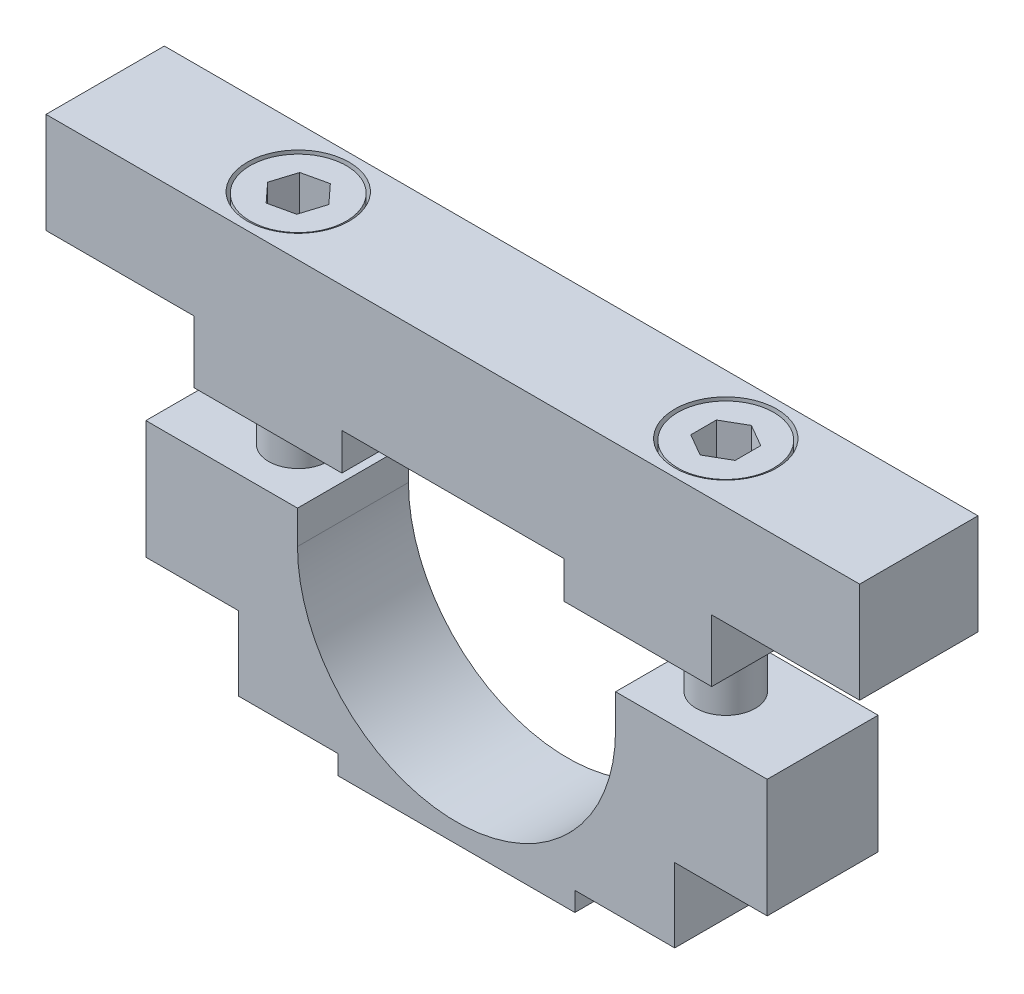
ISO-10303-21;
HEADER;
FILE_DESCRIPTION(('STEP AP214'),'2;1');
FILE_NAME('part.step','',(''),(''),'','','');
FILE_SCHEMA(('AUTOMOTIVE_DESIGN { 1 0 10303 214 1 1 1 1 }'));
ENDSEC;
DATA;
#1=APPLICATION_CONTEXT('core data for automotive mechanical design processes');
#2=APPLICATION_PROTOCOL_DEFINITION('international standard','automotive_design',2000,#1);
#3=PRODUCT_CONTEXT('',#1,'mechanical');
#4=PRODUCT('Part','Part','',(#3));
#5=PRODUCT_RELATED_PRODUCT_CATEGORY('part','',(#4));
#6=PRODUCT_DEFINITION_FORMATION('','',#4);
#7=PRODUCT_DEFINITION_CONTEXT('part definition',#1,'design');
#8=PRODUCT_DEFINITION('design','',#6,#7);
#9=PRODUCT_DEFINITION_SHAPE('','',#8);
#10=(LENGTH_UNIT() NAMED_UNIT(*) SI_UNIT(.MILLI.,.METRE.));
#11=(NAMED_UNIT(*) PLANE_ANGLE_UNIT() SI_UNIT($,.RADIAN.));
#12=(NAMED_UNIT(*) SI_UNIT($,.STERADIAN.) SOLID_ANGLE_UNIT());
#13=UNCERTAINTY_MEASURE_WITH_UNIT(LENGTH_MEASURE(1.E-05),#10,'distance_accuracy_value','');
#14=(GEOMETRIC_REPRESENTATION_CONTEXT(3) GLOBAL_UNCERTAINTY_ASSIGNED_CONTEXT((#13)) GLOBAL_UNIT_ASSIGNED_CONTEXT((#10,
#11,#12)) REPRESENTATION_CONTEXT('',''));
#15=CARTESIAN_POINT('',(0.,0.,0.));
#16=DIRECTION('',(0.,0.,1.));
#17=DIRECTION('',(1.,0.,0.));
#18=AXIS2_PLACEMENT_3D('',#15,#16,#17);
#19=CARTESIAN_POINT('',(0.,22.,0.));
#20=DIRECTION('',(0.,-1.,0.));
#21=DIRECTION('',(0.,0.,-1.));
#22=AXIS2_PLACEMENT_3D('',#19,#20,#21);
#23=PLANE('',#22);
#24=DIRECTION('',(0.,0.,-1.));
#25=VECTOR('',#24,1.);
#26=CARTESIAN_POINT('',(-55.,22.,-8.));
#27=LINE('',#26,#25);
#28=CARTESIAN_POINT('',(-55.,22.,-8.));
#29=VERTEX_POINT('',#28);
#30=CARTESIAN_POINT('',(-55.,22.,8.));
#31=VERTEX_POINT('',#30);
#32=EDGE_CURVE('E668',#29,#31,#27,.F.);
#33=ORIENTED_EDGE('',*,*,#32,.T.);
#34=DIRECTION('',(-1.,0.,0.));
#35=VECTOR('',#34,1.);
#36=CARTESIAN_POINT('',(55.,22.,8.));
#37=LINE('',#36,#35);
#38=CARTESIAN_POINT('',(55.,22.,8.));
#39=VERTEX_POINT('',#38);
#40=EDGE_CURVE('E683',#31,#39,#37,.F.);
#41=ORIENTED_EDGE('',*,*,#40,.T.);
#42=DIRECTION('',(0.,0.,-1.));
#43=VECTOR('',#42,1.);
#44=CARTESIAN_POINT('',(55.,22.,0.));
#45=LINE('',#44,#43);
#46=CARTESIAN_POINT('',(55.,22.,-8.));
#47=VERTEX_POINT('',#46);
#48=EDGE_CURVE('E40',#47,#39,#45,.F.);
#49=ORIENTED_EDGE('',*,*,#48,.F.);
#50=DIRECTION('',(1.,0.,0.));
#51=VECTOR('',#50,1.);
#52=CARTESIAN_POINT('',(55.,22.,-8.));
#53=LINE('',#52,#51);
#54=EDGE_CURVE('E674',#47,#29,#53,.F.);
#55=ORIENTED_EDGE('',*,*,#54,.T.);
#56=EDGE_LOOP('',(#33,#41,#49,#55));
#57=FACE_BOUND('',#56,.T.);
#58=CARTESIAN_POINT('',(-28.9,22.,0.));
#59=DIRECTION('',(0.,-1.,0.));
#60=DIRECTION('',(0.,0.,-1.));
#61=AXIS2_PLACEMENT_3D('',#58,#59,#60);
#62=CIRCLE('',#61,6.9);
#63=CARTESIAN_POINT('',(-28.9,22.,-6.9));
#64=VERTEX_POINT('',#63);
#65=EDGE_CURVE('E355',#64,#64,#62,.F.);
#66=ORIENTED_EDGE('',*,*,#65,.F.);
#67=EDGE_LOOP('',(#66));
#68=FACE_BOUND('',#67,.T.);
#69=CARTESIAN_POINT('',(28.9,22.,0.));
#70=DIRECTION('',(0.,-1.,0.));
#71=DIRECTION('',(0.,0.,-1.));
#72=AXIS2_PLACEMENT_3D('',#69,#70,#71);
#73=CIRCLE('',#72,6.9);
#74=CARTESIAN_POINT('',(28.9,22.,-6.9));
#75=VERTEX_POINT('',#74);
#76=EDGE_CURVE('E598',#75,#75,#73,.T.);
#77=ORIENTED_EDGE('',*,*,#76,.T.);
#78=EDGE_LOOP('',(#77));
#79=FACE_BOUND('',#78,.T.);
#80=ADVANCED_FACE('F17',(#57,#68,#79),#23,.F.);
#81=CARTESIAN_POINT('',(55.,22.,-8.));
#82=DIRECTION('',(0.,0.,1.));
#83=DIRECTION('',(1.,0.,0.));
#84=AXIS2_PLACEMENT_3D('',#81,#82,#83);
#85=PLANE('',#84);
#86=DIRECTION('',(0.,-1.,0.));
#87=VECTOR('',#86,1.);
#88=CARTESIAN_POINT('',(55.,22.,-8.));
#89=LINE('',#88,#87);
#90=CARTESIAN_POINT('',(55.,8.4,-8.));
#91=VERTEX_POINT('',#90);
#92=EDGE_CURVE('E672',#91,#47,#89,.F.);
#93=ORIENTED_EDGE('',*,*,#92,.F.);
#94=DIRECTION('',(1.,0.,0.));
#95=VECTOR('',#94,1.);
#96=CARTESIAN_POINT('',(55.,8.4,-8.));
#97=LINE('',#96,#95);
#98=CARTESIAN_POINT('',(35.,8.4,-8.));
#99=VERTEX_POINT('',#98);
#100=EDGE_CURVE('E628',#99,#91,#97,.T.);
#101=ORIENTED_EDGE('',*,*,#100,.F.);
#102=DIRECTION('',(0.,-1.,0.));
#103=VECTOR('',#102,1.);
#104=CARTESIAN_POINT('',(35.,8.4,-8.));
#105=LINE('',#104,#103);
#106=CARTESIAN_POINT('',(35.,0.,-8.));
#107=VERTEX_POINT('',#106);
#108=EDGE_CURVE('E616',#99,#107,#105,.T.);
#109=ORIENTED_EDGE('',*,*,#108,.T.);
#110=DIRECTION('',(-1.,0.,0.));
#111=VECTOR('',#110,1.);
#112=CARTESIAN_POINT('',(0.,0.,-8.));
#113=LINE('',#112,#111);
#114=CARTESIAN_POINT('',(15.,0.,-8.));
#115=VERTEX_POINT('',#114);
#116=EDGE_CURVE('E649',#107,#115,#113,.T.);
#117=ORIENTED_EDGE('',*,*,#116,.T.);
#118=DIRECTION('',(0.,-1.,0.));
#119=VECTOR('',#118,1.);
#120=CARTESIAN_POINT('',(15.,22.,-8.));
#121=LINE('',#120,#119);
#122=CARTESIAN_POINT('',(15.,5.,-8.));
#123=VERTEX_POINT('',#122);
#124=EDGE_CURVE('E624',#123,#115,#121,.T.);
#125=ORIENTED_EDGE('',*,*,#124,.F.);
#126=DIRECTION('',(-1.,0.,0.));
#127=VECTOR('',#126,1.);
#128=CARTESIAN_POINT('',(0.,5.,-8.));
#129=LINE('',#128,#127);
#130=CARTESIAN_POINT('',(-15.,5.,-8.));
#131=VERTEX_POINT('',#130);
#132=EDGE_CURVE('E646',#123,#131,#129,.T.);
#133=ORIENTED_EDGE('',*,*,#132,.T.);
#134=DIRECTION('',(0.,-1.,0.));
#135=VECTOR('',#134,1.);
#136=CARTESIAN_POINT('',(-15.,5.,-8.));
#137=LINE('',#136,#135);
#138=CARTESIAN_POINT('',(-15.,0.,-8.));
#139=VERTEX_POINT('',#138);
#140=EDGE_CURVE('E613',#131,#139,#137,.T.);
#141=ORIENTED_EDGE('',*,*,#140,.T.);
#142=DIRECTION('',(1.,0.,0.));
#143=VECTOR('',#142,1.);
#144=CARTESIAN_POINT('',(55.,0.,-8.));
#145=LINE('',#144,#143);
#146=CARTESIAN_POINT('',(-35.,0.,-8.));
#147=VERTEX_POINT('',#146);
#148=EDGE_CURVE('E644',#147,#139,#145,.T.);
#149=ORIENTED_EDGE('',*,*,#148,.F.);
#150=DIRECTION('',(0.,-1.,0.));
#151=VECTOR('',#150,1.);
#152=CARTESIAN_POINT('',(-35.,22.,-8.));
#153=LINE('',#152,#151);
#154=CARTESIAN_POINT('',(-35.,8.4,-8.));
#155=VERTEX_POINT('',#154);
#156=EDGE_CURVE('E608',#155,#147,#153,.T.);
#157=ORIENTED_EDGE('',*,*,#156,.F.);
#158=DIRECTION('',(-1.,0.,0.));
#159=VECTOR('',#158,1.);
#160=CARTESIAN_POINT('',(0.,8.4,-8.));
#161=LINE('',#160,#159);
#162=CARTESIAN_POINT('',(-55.,8.4,-8.));
#163=VERTEX_POINT('',#162);
#164=EDGE_CURVE('E641',#155,#163,#161,.T.);
#165=ORIENTED_EDGE('',*,*,#164,.T.);
#166=DIRECTION('',(0.,1.,0.));
#167=VECTOR('',#166,1.);
#168=CARTESIAN_POINT('',(-55.,22.,-8.));
#169=LINE('',#168,#167);
#170=EDGE_CURVE('E677',#29,#163,#169,.F.);
#171=ORIENTED_EDGE('',*,*,#170,.F.);
#172=ORIENTED_EDGE('',*,*,#54,.F.);
#173=EDGE_LOOP('',(#93,#101,#109,#117,#125,#133,#141,#149,#157,#165,#171,#172));
#174=FACE_BOUND('',#173,.T.);
#175=ADVANCED_FACE('F522',(#174),#85,.F.);
#176=CARTESIAN_POINT('',(0.,8.4,0.));
#177=DIRECTION('',(0.,-1.,0.));
#178=DIRECTION('',(0.,0.,-1.));
#179=AXIS2_PLACEMENT_3D('',#176,#177,#178);
#180=PLANE('',#179);
#181=ORIENTED_EDGE('',*,*,#100,.T.);
#182=DIRECTION('',(0.,0.,1.));
#183=VECTOR('',#182,1.);
#184=CARTESIAN_POINT('',(55.,8.4,-8.));
#185=LINE('',#184,#183);
#186=CARTESIAN_POINT('',(55.,8.4,8.));
#187=VERTEX_POINT('',#186);
#188=EDGE_CURVE('E32',#91,#187,#185,.T.);
#189=ORIENTED_EDGE('',*,*,#188,.T.);
#190=DIRECTION('',(1.,0.,0.));
#191=VECTOR('',#190,1.);
#192=CARTESIAN_POINT('',(0.,8.4,8.));
#193=LINE('',#192,#191);
#194=CARTESIAN_POINT('',(35.,8.4,8.));
#195=VERTEX_POINT('',#194);
#196=EDGE_CURVE('E652',#195,#187,#193,.T.);
#197=ORIENTED_EDGE('',*,*,#196,.F.);
#198=DIRECTION('',(0.,0.,-1.));
#199=VECTOR('',#198,1.);
#200=CARTESIAN_POINT('',(35.,8.4,8.));
#201=LINE('',#200,#199);
#202=EDGE_CURVE('E693',#99,#195,#201,.F.);
#203=ORIENTED_EDGE('',*,*,#202,.F.);
#204=EDGE_LOOP('',(#181,#189,#197,#203));
#205=FACE_BOUND('',#204,.T.);
#206=ADVANCED_FACE('F532',(#205),#180,.T.);
#207=CARTESIAN_POINT('',(35.,8.4,8.));
#208=DIRECTION('',(1.,0.,0.));
#209=DIRECTION('',(0.,0.,-1.));
#210=AXIS2_PLACEMENT_3D('',#207,#208,#209);
#211=PLANE('',#210);
#212=DIRECTION('',(0.,-1.,0.));
#213=VECTOR('',#212,1.);
#214=CARTESIAN_POINT('',(35.,22.,8.));
#215=LINE('',#214,#213);
#216=CARTESIAN_POINT('',(35.,0.,8.));
#217=VERTEX_POINT('',#216);
#218=EDGE_CURVE('E619',#195,#217,#215,.T.);
#219=ORIENTED_EDGE('',*,*,#218,.T.);
#220=DIRECTION('',(0.,0.,1.));
#221=VECTOR('',#220,1.);
#222=CARTESIAN_POINT('',(35.,0.,0.));
#223=LINE('',#222,#221);
#224=EDGE_CURVE('E654',#217,#107,#223,.F.);
#225=ORIENTED_EDGE('',*,*,#224,.T.);
#226=ORIENTED_EDGE('',*,*,#108,.F.);
#227=ORIENTED_EDGE('',*,*,#202,.T.);
#228=EDGE_LOOP('',(#219,#225,#226,#227));
#229=FACE_BOUND('',#228,.T.);
#230=ADVANCED_FACE('F555',(#229),#211,.T.);
#231=CARTESIAN_POINT('',(0.,0.,0.));
#232=DIRECTION('',(0.,-1.,0.));
#233=DIRECTION('',(0.,0.,-1.));
#234=AXIS2_PLACEMENT_3D('',#231,#232,#233);
#235=PLANE('',#234);
#236=CARTESIAN_POINT('',(28.9,0.,0.));
#237=DIRECTION('',(0.,-1.,0.));
#238=DIRECTION('',(0.,0.,-1.));
#239=AXIS2_PLACEMENT_3D('',#236,#237,#238);
#240=CIRCLE('',#239,4.1);
#241=CARTESIAN_POINT('',(28.9,0.,-4.1));
#242=VERTEX_POINT('',#241);
#243=EDGE_CURVE('E605',#242,#242,#240,.T.);
#244=ORIENTED_EDGE('',*,*,#243,.F.);
#245=EDGE_LOOP('',(#244));
#246=FACE_BOUND('',#245,.T.);
#247=ORIENTED_EDGE('',*,*,#116,.F.);
#248=ORIENTED_EDGE('',*,*,#224,.F.);
#249=DIRECTION('',(-1.,0.,0.));
#250=VECTOR('',#249,1.);
#251=CARTESIAN_POINT('',(55.,0.,8.));
#252=LINE('',#251,#250);
#253=CARTESIAN_POINT('',(15.,0.,8.));
#254=VERTEX_POINT('',#253);
#255=EDGE_CURVE('E630',#217,#254,#252,.T.);
#256=ORIENTED_EDGE('',*,*,#255,.T.);
#257=DIRECTION('',(0.,0.,1.));
#258=VECTOR('',#257,1.);
#259=CARTESIAN_POINT('',(15.,0.,8.));
#260=LINE('',#259,#258);
#261=EDGE_CURVE('E657',#254,#115,#260,.F.);
#262=ORIENTED_EDGE('',*,*,#261,.T.);
#263=EDGE_LOOP('',(#247,#248,#256,#262));
#264=FACE_BOUND('',#263,.T.);
#265=ADVANCED_FACE('F551',(#246,#264),#235,.T.);
#266=CARTESIAN_POINT('',(15.,5.,8.));
#267=DIRECTION('',(-1.,0.,0.));
#268=DIRECTION('',(0.,0.,1.));
#269=AXIS2_PLACEMENT_3D('',#266,#267,#268);
#270=PLANE('',#269);
#271=ORIENTED_EDGE('',*,*,#124,.T.);
#272=ORIENTED_EDGE('',*,*,#261,.F.);
#273=DIRECTION('',(0.,-1.,0.));
#274=VECTOR('',#273,1.);
#275=CARTESIAN_POINT('',(15.,5.,8.));
#276=LINE('',#275,#274);
#277=CARTESIAN_POINT('',(15.,5.,8.));
#278=VERTEX_POINT('',#277);
#279=EDGE_CURVE('E622',#278,#254,#276,.T.);
#280=ORIENTED_EDGE('',*,*,#279,.F.);
#281=DIRECTION('',(0.,0.,-1.));
#282=VECTOR('',#281,1.);
#283=CARTESIAN_POINT('',(15.,5.,0.));
#284=LINE('',#283,#282);
#285=EDGE_CURVE('E696',#123,#278,#284,.F.);
#286=ORIENTED_EDGE('',*,*,#285,.F.);
#287=EDGE_LOOP('',(#271,#272,#280,#286));
#288=FACE_BOUND('',#287,.T.);
#289=ADVANCED_FACE('F547',(#288),#270,.T.);
#290=CARTESIAN_POINT('',(0.,5.,0.));
#291=DIRECTION('',(0.,-1.,0.));
#292=DIRECTION('',(0.,0.,-1.));
#293=AXIS2_PLACEMENT_3D('',#290,#291,#292);
#294=PLANE('',#293);
#295=ORIENTED_EDGE('',*,*,#285,.T.);
#296=DIRECTION('',(1.,0.,0.));
#297=VECTOR('',#296,1.);
#298=CARTESIAN_POINT('',(0.,5.,8.));
#299=LINE('',#298,#297);
#300=CARTESIAN_POINT('',(-15.,5.,8.));
#301=VERTEX_POINT('',#300);
#302=EDGE_CURVE('E633',#301,#278,#299,.T.);
#303=ORIENTED_EDGE('',*,*,#302,.F.);
#304=DIRECTION('',(0.,0.,-1.));
#305=VECTOR('',#304,1.);
#306=CARTESIAN_POINT('',(-15.,5.,8.));
#307=LINE('',#306,#305);
#308=EDGE_CURVE('E723',#131,#301,#307,.F.);
#309=ORIENTED_EDGE('',*,*,#308,.F.);
#310=ORIENTED_EDGE('',*,*,#132,.F.);
#311=EDGE_LOOP('',(#295,#303,#309,#310));
#312=FACE_BOUND('',#311,.T.);
#313=ADVANCED_FACE('F543',(#312),#294,.T.);
#314=CARTESIAN_POINT('',(-15.,5.,8.));
#315=DIRECTION('',(1.,0.,0.));
#316=DIRECTION('',(0.,0.,-1.));
#317=AXIS2_PLACEMENT_3D('',#314,#315,#316);
#318=PLANE('',#317);
#319=DIRECTION('',(0.,-1.,0.));
#320=VECTOR('',#319,1.);
#321=CARTESIAN_POINT('',(-15.,22.,8.));
#322=LINE('',#321,#320);
#323=CARTESIAN_POINT('',(-15.,0.,8.));
#324=VERTEX_POINT('',#323);
#325=EDGE_CURVE('E610',#301,#324,#322,.T.);
#326=ORIENTED_EDGE('',*,*,#325,.T.);
#327=DIRECTION('',(0.,0.,1.));
#328=VECTOR('',#327,1.);
#329=CARTESIAN_POINT('',(-15.,0.,0.));
#330=LINE('',#329,#328);
#331=EDGE_CURVE('E660',#324,#139,#330,.F.);
#332=ORIENTED_EDGE('',*,*,#331,.T.);
#333=ORIENTED_EDGE('',*,*,#140,.F.);
#334=ORIENTED_EDGE('',*,*,#308,.T.);
#335=EDGE_LOOP('',(#326,#332,#333,#334));
#336=FACE_BOUND('',#335,.T.);
#337=ADVANCED_FACE('F539',(#336),#318,.T.);
#338=CARTESIAN_POINT('',(0.,0.,0.));
#339=DIRECTION('',(0.,-1.,0.));
#340=DIRECTION('',(0.,0.,-1.));
#341=AXIS2_PLACEMENT_3D('',#338,#339,#340);
#342=PLANE('',#341);
#343=CARTESIAN_POINT('',(-28.9,0.,0.));
#344=DIRECTION('',(0.,-1.,0.));
#345=DIRECTION('',(0.,0.,-1.));
#346=AXIS2_PLACEMENT_3D('',#343,#344,#345);
#347=CIRCLE('',#346,4.1);
#348=CARTESIAN_POINT('',(-28.9,0.,-4.1));
#349=VERTEX_POINT('',#348);
#350=EDGE_CURVE('E601',#349,#349,#347,.T.);
#351=ORIENTED_EDGE('',*,*,#350,.F.);
#352=EDGE_LOOP('',(#351));
#353=FACE_BOUND('',#352,.T.);
#354=DIRECTION('',(1.,0.,0.));
#355=VECTOR('',#354,1.);
#356=CARTESIAN_POINT('',(0.,0.,8.));
#357=LINE('',#356,#355);
#358=CARTESIAN_POINT('',(-35.,0.,8.));
#359=VERTEX_POINT('',#358);
#360=EDGE_CURVE('E636',#359,#324,#357,.T.);
#361=ORIENTED_EDGE('',*,*,#360,.F.);
#362=DIRECTION('',(0.,0.,1.));
#363=VECTOR('',#362,1.);
#364=CARTESIAN_POINT('',(-35.,0.,8.));
#365=LINE('',#364,#363);
#366=EDGE_CURVE('E663',#359,#147,#365,.F.);
#367=ORIENTED_EDGE('',*,*,#366,.T.);
#368=ORIENTED_EDGE('',*,*,#148,.T.);
#369=ORIENTED_EDGE('',*,*,#331,.F.);
#370=EDGE_LOOP('',(#361,#367,#368,#369));
#371=FACE_BOUND('',#370,.T.);
#372=ADVANCED_FACE('F535',(#353,#371),#342,.T.);
#373=CARTESIAN_POINT('',(-35.,8.4,8.));
#374=DIRECTION('',(-1.,0.,0.));
#375=DIRECTION('',(0.,0.,1.));
#376=AXIS2_PLACEMENT_3D('',#373,#374,#375);
#377=PLANE('',#376);
#378=ORIENTED_EDGE('',*,*,#156,.T.);
#379=ORIENTED_EDGE('',*,*,#366,.F.);
#380=DIRECTION('',(0.,-1.,0.));
#381=VECTOR('',#380,1.);
#382=CARTESIAN_POINT('',(-35.,8.4,8.));
#383=LINE('',#382,#381);
#384=CARTESIAN_POINT('',(-35.,8.4,8.));
#385=VERTEX_POINT('',#384);
#386=EDGE_CURVE('E626',#385,#359,#383,.T.);
#387=ORIENTED_EDGE('',*,*,#386,.F.);
#388=DIRECTION('',(0.,0.,-1.));
#389=VECTOR('',#388,1.);
#390=CARTESIAN_POINT('',(-35.,8.4,0.));
#391=LINE('',#390,#389);
#392=EDGE_CURVE('E602',#155,#385,#391,.F.);
#393=ORIENTED_EDGE('',*,*,#392,.F.);
#394=EDGE_LOOP('',(#378,#379,#387,#393));
#395=FACE_BOUND('',#394,.T.);
#396=ADVANCED_FACE('F530',(#395),#377,.T.);
#397=DIRECTION('',(-1.,0.,0.));
#398=VECTOR('',#397,1.);
#399=CARTESIAN_POINT('',(55.,8.4,8.));
#400=LINE('',#399,#398);
#401=CARTESIAN_POINT('',(-55.,8.4,8.));
#402=VERTEX_POINT('',#401);
#403=EDGE_CURVE('E638',#385,#402,#400,.T.);
#404=ORIENTED_EDGE('',*,*,#403,.T.);
#405=DIRECTION('',(0.,0.,1.));
#406=VECTOR('',#405,1.);
#407=CARTESIAN_POINT('',(-55.,8.4,0.));
#408=LINE('',#407,#406);
#409=EDGE_CURVE('E666',#163,#402,#408,.T.);
#410=ORIENTED_EDGE('',*,*,#409,.F.);
#411=ORIENTED_EDGE('',*,*,#164,.F.);
#412=ORIENTED_EDGE('',*,*,#392,.T.);
#413=EDGE_LOOP('',(#404,#410,#411,#412));
#414=FACE_BOUND('',#413,.T.);
#415=ADVANCED_FACE('F526',(#414),#180,.T.);
#416=CARTESIAN_POINT('',(-55.,22.,-8.));
#417=DIRECTION('',(1.,0.,0.));
#418=DIRECTION('',(0.,0.,-1.));
#419=AXIS2_PLACEMENT_3D('',#416,#417,#418);
#420=PLANE('',#419);
#421=ORIENTED_EDGE('',*,*,#409,.T.);
#422=DIRECTION('',(0.,-1.,0.));
#423=VECTOR('',#422,1.);
#424=CARTESIAN_POINT('',(-55.,22.,8.));
#425=LINE('',#424,#423);
#426=EDGE_CURVE('E680',#402,#31,#425,.F.);
#427=ORIENTED_EDGE('',*,*,#426,.T.);
#428=ORIENTED_EDGE('',*,*,#32,.F.);
#429=ORIENTED_EDGE('',*,*,#170,.T.);
#430=EDGE_LOOP('',(#421,#427,#428,#429));
#431=FACE_BOUND('',#430,.T.);
#432=ADVANCED_FACE('F519',(#431),#420,.F.);
#433=CARTESIAN_POINT('',(55.,22.,-8.));
#434=DIRECTION('',(-1.,0.,0.));
#435=DIRECTION('',(0.,0.,1.));
#436=AXIS2_PLACEMENT_3D('',#433,#434,#435);
#437=PLANE('',#436);
#438=ORIENTED_EDGE('',*,*,#188,.F.);
#439=ORIENTED_EDGE('',*,*,#92,.T.);
#440=ORIENTED_EDGE('',*,*,#48,.T.);
#441=DIRECTION('',(0.,1.,0.));
#442=VECTOR('',#441,1.);
#443=CARTESIAN_POINT('',(55.,22.,8.));
#444=LINE('',#443,#442);
#445=EDGE_CURVE('E686',#39,#187,#444,.F.);
#446=ORIENTED_EDGE('',*,*,#445,.T.);
#447=EDGE_LOOP('',(#438,#439,#440,#446));
#448=FACE_BOUND('',#447,.T.);
#449=ADVANCED_FACE('F515',(#448),#437,.F.);
#450=CARTESIAN_POINT('',(55.,22.,8.));
#451=DIRECTION('',(0.,0.,-1.));
#452=DIRECTION('',(-1.,0.,0.));
#453=AXIS2_PLACEMENT_3D('',#450,#451,#452);
#454=PLANE('',#453);
#455=ORIENTED_EDGE('',*,*,#426,.F.);
#456=ORIENTED_EDGE('',*,*,#403,.F.);
#457=ORIENTED_EDGE('',*,*,#386,.T.);
#458=ORIENTED_EDGE('',*,*,#360,.T.);
#459=ORIENTED_EDGE('',*,*,#325,.F.);
#460=ORIENTED_EDGE('',*,*,#302,.T.);
#461=ORIENTED_EDGE('',*,*,#279,.T.);
#462=ORIENTED_EDGE('',*,*,#255,.F.);
#463=ORIENTED_EDGE('',*,*,#218,.F.);
#464=ORIENTED_EDGE('',*,*,#196,.T.);
#465=ORIENTED_EDGE('',*,*,#445,.F.);
#466=ORIENTED_EDGE('',*,*,#40,.F.);
#467=EDGE_LOOP('',(#455,#456,#457,#458,#459,#460,#461,#462,#463,#464,#465,#466));
#468=FACE_BOUND('',#467,.T.);
#469=ADVANCED_FACE('F511',(#468),#454,.F.);
#470=CARTESIAN_POINT('',(28.9,13.8,0.));
#471=DIRECTION('',(0.,1.,0.));
#472=DIRECTION('',(0.,0.,1.));
#473=AXIS2_PLACEMENT_3D('',#470,#471,#472);
#474=CYLINDRICAL_SURFACE('',#473,4.1);
#475=CARTESIAN_POINT('',(28.9,13.8,0.));
#476=DIRECTION('',(0.,1.,0.));
#477=DIRECTION('',(0.,0.,1.));
#478=AXIS2_PLACEMENT_3D('',#475,#476,#477);
#479=CIRCLE('',#478,4.1);
#480=CARTESIAN_POINT('',(28.9,13.8,4.1));
#481=VERTEX_POINT('',#480);
#482=EDGE_CURVE('E591',#481,#481,#479,.F.);
#483=ORIENTED_EDGE('',*,*,#482,.F.);
#484=EDGE_LOOP('',(#483));
#485=FACE_BOUND('',#484,.T.);
#486=ORIENTED_EDGE('',*,*,#243,.T.);
#487=EDGE_LOOP('',(#486));
#488=FACE_BOUND('',#487,.T.);
#489=ADVANCED_FACE('F514',(#485,#488),#474,.F.);
#490=CARTESIAN_POINT('',(28.9,13.8,0.));
#491=DIRECTION('',(0.,1.,0.));
#492=DIRECTION('',(0.,0.,1.));
#493=AXIS2_PLACEMENT_3D('',#490,#491,#492);
#494=PLANE('',#493);
#495=CARTESIAN_POINT('',(28.9,13.8,0.));
#496=DIRECTION('',(0.,1.,0.));
#497=DIRECTION('',(0.,0.,1.));
#498=AXIS2_PLACEMENT_3D('',#495,#496,#497);
#499=CIRCLE('',#498,6.5);
#500=CARTESIAN_POINT('',(28.9,13.8,6.5));
#501=VERTEX_POINT('',#500);
#502=EDGE_CURVE('E11',#501,#501,#499,.T.);
#503=ORIENTED_EDGE('',*,*,#502,.F.);
#504=EDGE_LOOP('',(#503));
#505=FACE_BOUND('',#504,.T.);
#506=CARTESIAN_POINT('',(28.9,13.8,0.));
#507=DIRECTION('',(0.,1.,0.));
#508=DIRECTION('',(0.,0.,1.));
#509=AXIS2_PLACEMENT_3D('',#506,#507,#508);
#510=CIRCLE('',#509,6.9);
#511=CARTESIAN_POINT('',(28.9,13.8,6.9));
#512=VERTEX_POINT('',#511);
#513=EDGE_CURVE('E694',#512,#512,#510,.T.);
#514=ORIENTED_EDGE('',*,*,#513,.T.);
#515=EDGE_LOOP('',(#514));
#516=FACE_BOUND('',#515,.T.);
#517=ADVANCED_FACE('F568',(#505,#516),#494,.T.);
#518=CARTESIAN_POINT('',(28.9,13.8,0.));
#519=DIRECTION('',(0.,1.,0.));
#520=DIRECTION('',(0.,0.,1.));
#521=AXIS2_PLACEMENT_3D('',#518,#519,#520);
#522=CYLINDRICAL_SURFACE('',#521,6.9);
#523=ORIENTED_EDGE('',*,*,#513,.F.);
#524=EDGE_LOOP('',(#523));
#525=FACE_BOUND('',#524,.T.);
#526=ORIENTED_EDGE('',*,*,#76,.F.);
#527=EDGE_LOOP('',(#526));
#528=FACE_BOUND('',#527,.T.);
#529=ADVANCED_FACE('F571',(#525,#528),#522,.F.);
#530=CARTESIAN_POINT('',(-28.9,13.8,0.));
#531=DIRECTION('',(0.,1.,0.));
#532=DIRECTION('',(0.,0.,1.));
#533=AXIS2_PLACEMENT_3D('',#530,#531,#532);
#534=CYLINDRICAL_SURFACE('',#533,6.9);
#535=CARTESIAN_POINT('',(-28.9,13.8,0.));
#536=DIRECTION('',(0.,1.,0.));
#537=DIRECTION('',(0.,0.,1.));
#538=AXIS2_PLACEMENT_3D('',#535,#536,#537);
#539=CIRCLE('',#538,6.9);
#540=CARTESIAN_POINT('',(-28.9,13.8,6.9));
#541=VERTEX_POINT('',#540);
#542=EDGE_CURVE('E587',#541,#541,#539,.T.);
#543=ORIENTED_EDGE('',*,*,#542,.F.);
#544=EDGE_LOOP('',(#543));
#545=FACE_BOUND('',#544,.T.);
#546=ORIENTED_EDGE('',*,*,#65,.T.);
#547=EDGE_LOOP('',(#546));
#548=FACE_BOUND('',#547,.T.);
#549=ADVANCED_FACE('F566',(#545,#548),#534,.F.);
#550=CARTESIAN_POINT('',(-28.9,13.8,0.));
#551=DIRECTION('',(0.,1.,0.));
#552=DIRECTION('',(0.,0.,1.));
#553=AXIS2_PLACEMENT_3D('',#550,#551,#552);
#554=PLANE('',#553);
#555=CARTESIAN_POINT('',(-28.9,13.8,0.));
#556=DIRECTION('',(0.,1.,0.));
#557=DIRECTION('',(0.,0.,1.));
#558=AXIS2_PLACEMENT_3D('',#555,#556,#557);
#559=CIRCLE('',#558,6.5);
#560=CARTESIAN_POINT('',(-28.9,13.8,6.5));
#561=VERTEX_POINT('',#560);
#562=EDGE_CURVE('E25',#561,#561,#559,.T.);
#563=ORIENTED_EDGE('',*,*,#562,.F.);
#564=EDGE_LOOP('',(#563));
#565=FACE_BOUND('',#564,.T.);
#566=ORIENTED_EDGE('',*,*,#542,.T.);
#567=EDGE_LOOP('',(#566));
#568=FACE_BOUND('',#567,.T.);
#569=ADVANCED_FACE('F563',(#565,#568),#554,.T.);
#570=CARTESIAN_POINT('',(-28.9,13.8,0.));
#571=DIRECTION('',(0.,1.,0.));
#572=DIRECTION('',(0.,0.,1.));
#573=AXIS2_PLACEMENT_3D('',#570,#571,#572);
#574=CYLINDRICAL_SURFACE('',#573,4.1);
#575=CARTESIAN_POINT('',(-28.9,13.8,0.));
#576=DIRECTION('',(0.,1.,0.));
#577=DIRECTION('',(0.,0.,1.));
#578=AXIS2_PLACEMENT_3D('',#575,#576,#577);
#579=CIRCLE('',#578,4.1);
#580=CARTESIAN_POINT('',(-28.9,13.8,4.1));
#581=VERTEX_POINT('',#580);
#582=EDGE_CURVE('E594',#581,#581,#579,.F.);
#583=ORIENTED_EDGE('',*,*,#582,.F.);
#584=EDGE_LOOP('',(#583));
#585=FACE_BOUND('',#584,.T.);
#586=ORIENTED_EDGE('',*,*,#350,.T.);
#587=EDGE_LOOP('',(#586));
#588=FACE_BOUND('',#587,.T.);
#589=ADVANCED_FACE('F19',(#585,#588),#574,.F.);
#590=CARTESIAN_POINT('',(28.9,-16.2,0.));
#591=DIRECTION('',(0.,1.,0.));
#592=DIRECTION('',(0.,0.,1.));
#593=AXIS2_PLACEMENT_3D('',#590,#591,#592);
#594=PLANE('',#593);
#595=CARTESIAN_POINT('',(28.9,-16.2,0.));
#596=DIRECTION('',(0.,1.,0.));
#597=DIRECTION('',(0.,0.,1.));
#598=AXIS2_PLACEMENT_3D('',#595,#596,#597);
#599=CIRCLE('',#598,3.4);
#600=CARTESIAN_POINT('',(28.9,-16.2,3.4));
#601=VERTEX_POINT('',#600);
#602=EDGE_CURVE('E352',#601,#601,#599,.T.);
#603=ORIENTED_EDGE('',*,*,#602,.F.);
#604=EDGE_LOOP('',(#603));
#605=FACE_BOUND('',#604,.T.);
#606=ADVANCED_FACE('F708',(#605),#594,.F.);
#607=CARTESIAN_POINT('',(28.9,13.8,0.));
#608=DIRECTION('',(0.,1.,0.));
#609=DIRECTION('',(0.,0.,1.));
#610=AXIS2_PLACEMENT_3D('',#607,#608,#609);
#611=CYLINDRICAL_SURFACE('',#610,4.);
#612=CARTESIAN_POINT('',(28.9,13.8,0.));
#613=DIRECTION('',(0.,1.,0.));
#614=DIRECTION('',(0.,0.,1.));
#615=AXIS2_PLACEMENT_3D('',#612,#613,#614);
#616=CIRCLE('',#615,4.);
#617=CARTESIAN_POINT('',(28.9,13.8,4.));
#618=VERTEX_POINT('',#617);
#619=EDGE_CURVE('E342',#618,#618,#616,.F.);
#620=ORIENTED_EDGE('',*,*,#619,.T.);
#621=EDGE_LOOP('',(#620));
#622=FACE_BOUND('',#621,.T.);
#623=CARTESIAN_POINT('',(28.9,-7.6,0.));
#624=DIRECTION('',(0.,-1.,0.));
#625=DIRECTION('',(0.,0.,-1.));
#626=AXIS2_PLACEMENT_3D('',#623,#624,#625);
#627=CIRCLE('',#626,4.);
#628=CARTESIAN_POINT('',(28.9,-7.6,-4.));
#629=VERTEX_POINT('',#628);
#630=EDGE_CURVE('E349',#629,#629,#627,.F.);
#631=ORIENTED_EDGE('',*,*,#630,.T.);
#632=EDGE_LOOP('',(#631));
#633=FACE_BOUND('',#632,.T.);
#634=ADVANCED_FACE('F951',(#622,#633),#611,.T.);
#635=CARTESIAN_POINT('',(-28.9,-16.2,0.));
#636=DIRECTION('',(0.,1.,0.));
#637=DIRECTION('',(-0.298116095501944,0.,0.954529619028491));
#638=AXIS2_PLACEMENT_3D('',#635,#636,#637);
#639=PLANE('',#638);
#640=CARTESIAN_POINT('',(-28.9,-16.2,0.));
#641=DIRECTION('',(0.,1.,0.));
#642=DIRECTION('',(-1.,0.,0.));
#643=AXIS2_PLACEMENT_3D('',#640,#641,#642);
#644=CIRCLE('',#643,3.4);
#645=CARTESIAN_POINT('',(-32.3,-16.2,0.));
#646=VERTEX_POINT('',#645);
#647=EDGE_CURVE('E341',#646,#646,#644,.T.);
#648=ORIENTED_EDGE('',*,*,#647,.F.);
#649=EDGE_LOOP('',(#648));
#650=FACE_BOUND('',#649,.T.);
#651=ADVANCED_FACE('F957',(#650),#639,.F.);
#652=CARTESIAN_POINT('',(-28.9,13.8,0.));
#653=DIRECTION('',(0.,1.,0.));
#654=DIRECTION('',(-0.298116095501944,0.,0.954529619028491));
#655=AXIS2_PLACEMENT_3D('',#652,#653,#654);
#656=CYLINDRICAL_SURFACE('',#655,4.);
#657=CARTESIAN_POINT('',(-28.9,13.8,0.));
#658=DIRECTION('',(0.,1.,0.));
#659=DIRECTION('',(-0.298116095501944,0.,0.954529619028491));
#660=AXIS2_PLACEMENT_3D('',#657,#658,#659);
#661=CIRCLE('',#660,4.);
#662=CARTESIAN_POINT('',(-30.0924643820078,13.8,3.81811847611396));
#663=VERTEX_POINT('',#662);
#664=EDGE_CURVE('E359',#663,#663,#661,.F.);
#665=ORIENTED_EDGE('',*,*,#664,.T.);
#666=EDGE_LOOP('',(#665));
#667=FACE_BOUND('',#666,.T.);
#668=CARTESIAN_POINT('',(-28.9,-7.6,0.));
#669=DIRECTION('',(0.,-1.,0.));
#670=DIRECTION('',(0.,0.,-1.));
#671=AXIS2_PLACEMENT_3D('',#668,#669,#670);
#672=CIRCLE('',#671,4.);
#673=CARTESIAN_POINT('',(-28.9,-7.6,-4.));
#674=VERTEX_POINT('',#673);
#675=EDGE_CURVE('E409',#674,#674,#672,.F.);
#676=ORIENTED_EDGE('',*,*,#675,.T.);
#677=EDGE_LOOP('',(#676));
#678=FACE_BOUND('',#677,.T.);
#679=ADVANCED_FACE('F922',(#667,#678),#656,.T.);
#680=CARTESIAN_POINT('',(21.5,-7.6,-7.5));
#681=DIRECTION('',(1.,0.,0.));
#682=DIRECTION('',(0.,1.,0.));
#683=AXIS2_PLACEMENT_3D('',#680,#681,#682);
#684=PLANE('',#683);
#685=DIRECTION('',(0.,0.,1.));
#686=VECTOR('',#685,1.);
#687=CARTESIAN_POINT('',(21.5,-7.6,0.));
#688=LINE('',#687,#686);
#689=CARTESIAN_POINT('',(21.5,-7.6,-7.5));
#690=VERTEX_POINT('',#689);
#691=CARTESIAN_POINT('',(21.5,-7.6,7.5));
#692=VERTEX_POINT('',#691);
#693=EDGE_CURVE('E857',#690,#692,#688,.T.);
#694=ORIENTED_EDGE('',*,*,#693,.F.);
#695=DIRECTION('',(0.,1.,0.));
#696=VECTOR('',#695,1.);
#697=CARTESIAN_POINT('',(21.5,-7.6,-7.5));
#698=LINE('',#697,#696);
#699=CARTESIAN_POINT('',(21.5,-12.1,-7.5));
#700=VERTEX_POINT('',#699);
#701=EDGE_CURVE('E417',#690,#700,#698,.F.);
#702=ORIENTED_EDGE('',*,*,#701,.T.);
#703=DIRECTION('',(0.,0.,1.));
#704=VECTOR('',#703,1.);
#705=CARTESIAN_POINT('',(21.5,-12.1,-7.5));
#706=LINE('',#705,#704);
#707=CARTESIAN_POINT('',(21.5,-12.1,7.5));
#708=VERTEX_POINT('',#707);
#709=EDGE_CURVE('E414',#708,#700,#706,.F.);
#710=ORIENTED_EDGE('',*,*,#709,.F.);
#711=DIRECTION('',(0.,1.,0.));
#712=VECTOR('',#711,1.);
#713=CARTESIAN_POINT('',(21.5,-7.6,7.5));
#714=LINE('',#713,#712);
#715=EDGE_CURVE('E874',#692,#708,#714,.F.);
#716=ORIENTED_EDGE('',*,*,#715,.F.);
#717=EDGE_LOOP('',(#694,#702,#710,#716));
#718=FACE_BOUND('',#717,.T.);
#719=ADVANCED_FACE('F509',(#718),#684,.F.);
#720=CARTESIAN_POINT('',(0.,-23.6,0.));
#721=DIRECTION('',(0.,-1.,0.));
#722=DIRECTION('',(0.,0.,-1.));
#723=AXIS2_PLACEMENT_3D('',#720,#721,#722);
#724=PLANE('',#723);
#725=DIRECTION('',(0.,0.,-1.));
#726=VECTOR('',#725,1.);
#727=CARTESIAN_POINT('',(29.5,-23.6,0.));
#728=LINE('',#727,#726);
#729=CARTESIAN_POINT('',(29.5,-23.6000000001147,-0.256487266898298));
#730=VERTEX_POINT('',#729);
#731=CARTESIAN_POINT('',(29.5,-23.6,-7.5));
#732=VERTEX_POINT('',#731);
#733=EDGE_CURVE('E418',#730,#732,#728,.T.);
#734=ORIENTED_EDGE('',*,*,#733,.T.);
#735=DIRECTION('',(1.,0.,0.));
#736=VECTOR('',#735,1.);
#737=CARTESIAN_POINT('',(42.,-23.6,-7.5));
#738=LINE('',#737,#736);
#739=CARTESIAN_POINT('',(42.,-23.6,-7.5));
#740=VERTEX_POINT('',#739);
#741=EDGE_CURVE('E830',#732,#740,#738,.T.);
#742=ORIENTED_EDGE('',*,*,#741,.T.);
#743=DIRECTION('',(0.,0.,1.));
#744=VECTOR('',#743,1.);
#745=CARTESIAN_POINT('',(42.,-23.6,-7.5));
#746=LINE('',#745,#744);
#747=CARTESIAN_POINT('',(42.,-23.6,7.5));
#748=VERTEX_POINT('',#747);
#749=EDGE_CURVE('E495',#740,#748,#746,.T.);
#750=ORIENTED_EDGE('',*,*,#749,.T.);
#751=DIRECTION('',(-1.,0.,0.));
#752=VECTOR('',#751,1.);
#753=CARTESIAN_POINT('',(42.,-23.6,7.5));
#754=LINE('',#753,#752);
#755=CARTESIAN_POINT('',(29.5,-23.6,7.5));
#756=VERTEX_POINT('',#755);
#757=EDGE_CURVE('E824',#748,#756,#754,.T.);
#758=ORIENTED_EDGE('',*,*,#757,.T.);
#759=DIRECTION('',(0.,0.,-1.));
#760=VECTOR('',#759,1.);
#761=CARTESIAN_POINT('',(29.5,-23.6,0.));
#762=LINE('',#761,#760);
#763=CARTESIAN_POINT('',(29.5,-23.6000000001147,0.256487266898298));
#764=VERTEX_POINT('',#763);
#765=EDGE_CURVE('E421',#756,#764,#762,.T.);
#766=ORIENTED_EDGE('',*,*,#765,.T.);
#767=CARTESIAN_POINT('',(28.9,-23.6000000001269,0.));
#768=DIRECTION('',(0.,1.,0.));
#769=DIRECTION('',(-1.,0.,0.));
#770=AXIS2_PLACEMENT_3D('',#767,#768,#769);
#771=CIRCLE('',#770,0.652522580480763);
#772=EDGE_CURVE('E420',#764,#730,#771,.T.);
#773=ORIENTED_EDGE('',*,*,#772,.T.);
#774=EDGE_LOOP('',(#734,#742,#750,#758,#766,#773));
#775=FACE_BOUND('',#774,.T.);
#776=ADVANCED_FACE('F503',(#775),#724,.T.);
#777=CARTESIAN_POINT('',(29.5,-23.6,7.5));
#778=DIRECTION('',(1.,0.,0.));
#779=DIRECTION('',(0.,0.,-1.));
#780=AXIS2_PLACEMENT_3D('',#777,#778,#779);
#781=PLANE('',#780);
#782=CARTESIAN_POINT('',(29.5,-23.6000000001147,-0.256487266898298));
#783=CARTESIAN_POINT('',(29.5,-23.6030465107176,-0.23519688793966));
#784=CARTESIAN_POINT('',(29.5,-23.605777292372,-0.213860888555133));
#785=CARTESIAN_POINT('',(29.5,-23.6105313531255,-0.171104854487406));
#786=CARTESIAN_POINT('',(29.5,-23.6125544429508,-0.149684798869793));
#787=CARTESIAN_POINT('',(29.5,-23.6174269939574,-0.085574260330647));
#788=CARTESIAN_POINT('',(29.5,-23.6191166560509,-0.0427871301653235));
#789=CARTESIAN_POINT('',(29.5,-23.6191166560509,0.0427871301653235));
#790=CARTESIAN_POINT('',(29.5,-23.6174269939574,0.085574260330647));
#791=CARTESIAN_POINT('',(29.5,-23.6125544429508,0.149684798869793));
#792=CARTESIAN_POINT('',(29.5,-23.6105313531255,0.171104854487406));
#793=CARTESIAN_POINT('',(29.5,-23.605777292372,0.213860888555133));
#794=CARTESIAN_POINT('',(29.5,-23.6030465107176,0.23519688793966));
#795=CARTESIAN_POINT('',(29.5,-23.6000000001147,0.256487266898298));
#796=B_SPLINE_CURVE_WITH_KNOTS('',3,(#782,#783,#784,#785,#786,#787,#788,#789,#790,#791,#792,
#793,#794,#795),.UNSPECIFIED.,.F.,.F.,(4,2,2,2,2,2,4),(0.,0.0645188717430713,0.129054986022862,
0.257381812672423,0.385708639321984,0.450244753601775,0.514763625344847),.UNSPECIFIED.);
#797=EDGE_CURVE('E424',#730,#764,#796,.T.);
#798=ORIENTED_EDGE('',*,*,#797,.T.);
#799=ORIENTED_EDGE('',*,*,#765,.F.);
#800=DIRECTION('',(0.,-1.,0.));
#801=VECTOR('',#800,1.);
#802=CARTESIAN_POINT('',(29.5,-7.6,7.5));
#803=LINE('',#802,#801);
#804=CARTESIAN_POINT('',(29.5,-33.6,7.5));
#805=VERTEX_POINT('',#804);
#806=EDGE_CURVE('E827',#756,#805,#803,.T.);
#807=ORIENTED_EDGE('',*,*,#806,.T.);
#808=DIRECTION('',(0.,0.,1.));
#809=VECTOR('',#808,1.);
#810=CARTESIAN_POINT('',(29.5,-33.6,0.));
#811=LINE('',#810,#809);
#812=CARTESIAN_POINT('',(29.5,-33.6,-7.5));
#813=VERTEX_POINT('',#812);
#814=EDGE_CURVE('E822',#813,#805,#811,.T.);
#815=ORIENTED_EDGE('',*,*,#814,.F.);
#816=DIRECTION('',(0.,1.,0.));
#817=VECTOR('',#816,1.);
#818=CARTESIAN_POINT('',(29.5,-7.6,-7.5));
#819=LINE('',#818,#817);
#820=EDGE_CURVE('E831',#813,#732,#819,.T.);
#821=ORIENTED_EDGE('',*,*,#820,.T.);
#822=ORIENTED_EDGE('',*,*,#733,.F.);
#823=EDGE_LOOP('',(#798,#799,#807,#815,#821,#822));
#824=FACE_BOUND('',#823,.T.);
#825=ADVANCED_FACE('F497',(#824),#781,.T.);
#826=CARTESIAN_POINT('',(0.,-33.6,0.));
#827=DIRECTION('',(0.,-1.,0.));
#828=DIRECTION('',(0.,0.,-1.));
#829=AXIS2_PLACEMENT_3D('',#826,#827,#828);
#830=PLANE('',#829);
#831=DIRECTION('',(1.,0.,0.));
#832=VECTOR('',#831,1.);
#833=CARTESIAN_POINT('',(42.,-33.6,-7.5));
#834=LINE('',#833,#832);
#835=CARTESIAN_POINT('',(16.,-33.6,-7.5));
#836=VERTEX_POINT('',#835);
#837=EDGE_CURVE('E493',#836,#813,#834,.T.);
#838=ORIENTED_EDGE('',*,*,#837,.T.);
#839=ORIENTED_EDGE('',*,*,#814,.T.);
#840=DIRECTION('',(1.,0.,0.));
#841=VECTOR('',#840,1.);
#842=CARTESIAN_POINT('',(0.,-33.6,7.5));
#843=LINE('',#842,#841);
#844=CARTESIAN_POINT('',(16.,-33.6,7.5));
#845=VERTEX_POINT('',#844);
#846=EDGE_CURVE('E839',#845,#805,#843,.T.);
#847=ORIENTED_EDGE('',*,*,#846,.F.);
#848=DIRECTION('',(0.,0.,-1.));
#849=VECTOR('',#848,1.);
#850=CARTESIAN_POINT('',(16.,-33.6,0.));
#851=LINE('',#850,#849);
#852=EDGE_CURVE('E425',#845,#836,#851,.T.);
#853=ORIENTED_EDGE('',*,*,#852,.T.);
#854=EDGE_LOOP('',(#838,#839,#847,#853));
#855=FACE_BOUND('',#854,.T.);
#856=ADVANCED_FACE('F502',(#855),#830,.T.);
#857=CARTESIAN_POINT('',(16.,-33.6,7.5));
#858=DIRECTION('',(1.,0.,0.));
#859=DIRECTION('',(0.,0.,-1.));
#860=AXIS2_PLACEMENT_3D('',#857,#858,#859);
#861=PLANE('',#860);
#862=DIRECTION('',(0.,-1.,0.));
#863=VECTOR('',#862,1.);
#864=CARTESIAN_POINT('',(16.,-7.6,7.5));
#865=LINE('',#864,#863);
#866=CARTESIAN_POINT('',(16.,-36.2,7.5));
#867=VERTEX_POINT('',#866);
#868=EDGE_CURVE('E804',#845,#867,#865,.T.);
#869=ORIENTED_EDGE('',*,*,#868,.T.);
#870=DIRECTION('',(0.,0.,1.));
#871=VECTOR('',#870,1.);
#872=CARTESIAN_POINT('',(16.,-36.2,0.));
#873=LINE('',#872,#871);
#874=CARTESIAN_POINT('',(16.,-36.2,-7.5));
#875=VERTEX_POINT('',#874);
#876=EDGE_CURVE('E403',#867,#875,#873,.F.);
#877=ORIENTED_EDGE('',*,*,#876,.T.);
#878=DIRECTION('',(0.,-1.,0.));
#879=VECTOR('',#878,1.);
#880=CARTESIAN_POINT('',(16.,-33.6,-7.5));
#881=LINE('',#880,#879);
#882=EDGE_CURVE('E817',#836,#875,#881,.T.);
#883=ORIENTED_EDGE('',*,*,#882,.F.);
#884=ORIENTED_EDGE('',*,*,#852,.F.);
#885=EDGE_LOOP('',(#869,#877,#883,#884));
#886=FACE_BOUND('',#885,.T.);
#887=ADVANCED_FACE('F1006',(#886),#861,.T.);
#888=CARTESIAN_POINT('',(0.,-36.2,0.));
#889=DIRECTION('',(0.,-1.,0.));
#890=DIRECTION('',(0.,0.,-1.));
#891=AXIS2_PLACEMENT_3D('',#888,#889,#890);
#892=PLANE('',#891);
#893=DIRECTION('',(-1.,0.,0.));
#894=VECTOR('',#893,1.);
#895=CARTESIAN_POINT('',(0.,-36.2,-7.5));
#896=LINE('',#895,#894);
#897=CARTESIAN_POINT('',(-16.,-36.2,-7.5));
#898=VERTEX_POINT('',#897);
#899=EDGE_CURVE('E774',#875,#898,#896,.T.);
#900=ORIENTED_EDGE('',*,*,#899,.F.);
#901=ORIENTED_EDGE('',*,*,#876,.F.);
#902=DIRECTION('',(1.,0.,0.));
#903=VECTOR('',#902,1.);
#904=CARTESIAN_POINT('',(0.,-36.2,7.5));
#905=LINE('',#904,#903);
#906=CARTESIAN_POINT('',(-16.,-36.2,7.5));
#907=VERTEX_POINT('',#906);
#908=EDGE_CURVE('E765',#907,#867,#905,.T.);
#909=ORIENTED_EDGE('',*,*,#908,.F.);
#910=DIRECTION('',(0.,0.,-1.));
#911=VECTOR('',#910,1.);
#912=CARTESIAN_POINT('',(-16.,-36.2,0.));
#913=LINE('',#912,#911);
#914=EDGE_CURVE('E769',#898,#907,#913,.F.);
#915=ORIENTED_EDGE('',*,*,#914,.F.);
#916=EDGE_LOOP('',(#900,#901,#909,#915));
#917=FACE_BOUND('',#916,.T.);
#918=ADVANCED_FACE('F1009',(#917),#892,.T.);
#919=CARTESIAN_POINT('',(-16.,-33.6,7.5));
#920=DIRECTION('',(-1.,0.,0.));
#921=DIRECTION('',(0.,0.,1.));
#922=AXIS2_PLACEMENT_3D('',#919,#920,#921);
#923=PLANE('',#922);
#924=DIRECTION('',(0.,-1.,0.));
#925=VECTOR('',#924,1.);
#926=CARTESIAN_POINT('',(-16.,-7.6,-7.5));
#927=LINE('',#926,#925);
#928=CARTESIAN_POINT('',(-16.,-33.6,-7.5));
#929=VERTEX_POINT('',#928);
#930=EDGE_CURVE('E809',#929,#898,#927,.T.);
#931=ORIENTED_EDGE('',*,*,#930,.T.);
#932=ORIENTED_EDGE('',*,*,#914,.T.);
#933=DIRECTION('',(0.,-1.,0.));
#934=VECTOR('',#933,1.);
#935=CARTESIAN_POINT('',(-16.,-33.6,7.5));
#936=LINE('',#935,#934);
#937=CARTESIAN_POINT('',(-16.,-33.6,7.5));
#938=VERTEX_POINT('',#937);
#939=EDGE_CURVE('E813',#938,#907,#936,.T.);
#940=ORIENTED_EDGE('',*,*,#939,.F.);
#941=DIRECTION('',(0.,0.,1.));
#942=VECTOR('',#941,1.);
#943=CARTESIAN_POINT('',(-16.,-33.6,7.5));
#944=LINE('',#943,#942);
#945=EDGE_CURVE('E427',#938,#929,#944,.F.);
#946=ORIENTED_EDGE('',*,*,#945,.T.);
#947=EDGE_LOOP('',(#931,#932,#940,#946));
#948=FACE_BOUND('',#947,.T.);
#949=ADVANCED_FACE('F1012',(#948),#923,.T.);
#950=CARTESIAN_POINT('',(0.,-33.6,0.));
#951=DIRECTION('',(0.,-1.,0.));
#952=DIRECTION('',(0.,0.,-1.));
#953=AXIS2_PLACEMENT_3D('',#950,#951,#952);
#954=PLANE('',#953);
#955=DIRECTION('',(-1.,0.,0.));
#956=VECTOR('',#955,1.);
#957=CARTESIAN_POINT('',(0.,-33.6,-7.5));
#958=LINE('',#957,#956);
#959=CARTESIAN_POINT('',(-29.5,-33.6,-7.5));
#960=VERTEX_POINT('',#959);
#961=EDGE_CURVE('E785',#929,#960,#958,.T.);
#962=ORIENTED_EDGE('',*,*,#961,.F.);
#963=ORIENTED_EDGE('',*,*,#945,.F.);
#964=DIRECTION('',(-1.,0.,0.));
#965=VECTOR('',#964,1.);
#966=CARTESIAN_POINT('',(42.,-33.6,7.5));
#967=LINE('',#966,#965);
#968=CARTESIAN_POINT('',(-29.5,-33.6,7.5));
#969=VERTEX_POINT('',#968);
#970=EDGE_CURVE('E782',#938,#969,#967,.T.);
#971=ORIENTED_EDGE('',*,*,#970,.T.);
#972=DIRECTION('',(0.,0.,-1.));
#973=VECTOR('',#972,1.);
#974=CARTESIAN_POINT('',(-29.5,-33.6,0.));
#975=LINE('',#974,#973);
#976=EDGE_CURVE('E779',#960,#969,#975,.F.);
#977=ORIENTED_EDGE('',*,*,#976,.F.);
#978=EDGE_LOOP('',(#962,#963,#971,#977));
#979=FACE_BOUND('',#978,.T.);
#980=ADVANCED_FACE('F472',(#979),#954,.T.);
#981=CARTESIAN_POINT('',(-29.5,-23.6,7.5));
#982=DIRECTION('',(-1.,0.,0.));
#983=DIRECTION('',(0.,0.,1.));
#984=AXIS2_PLACEMENT_3D('',#981,#982,#983);
#985=PLANE('',#984);
#986=CARTESIAN_POINT('',(-29.5,-23.6000000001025,0.256487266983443));
#987=CARTESIAN_POINT('',(-29.5,-23.6030465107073,0.235196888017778));
#988=CARTESIAN_POINT('',(-29.5,-23.6057772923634,0.21386088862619));
#989=CARTESIAN_POINT('',(-29.5,-23.6105313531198,0.171104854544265));
#990=CARTESIAN_POINT('',(-29.5,-23.6125544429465,0.149684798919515));
#991=CARTESIAN_POINT('',(-29.5,-23.6174269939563,0.0855742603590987));
#992=CARTESIAN_POINT('',(-29.5,-23.6191166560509,0.0427871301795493));
#993=CARTESIAN_POINT('',(-29.5,-23.6191166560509,-0.0427871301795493));
#994=CARTESIAN_POINT('',(-29.5,-23.6174269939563,-0.0855742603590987));
#995=CARTESIAN_POINT('',(-29.5,-23.6125544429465,-0.149684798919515));
#996=CARTESIAN_POINT('',(-29.5,-23.6105313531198,-0.171104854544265));
#997=CARTESIAN_POINT('',(-29.5,-23.6057772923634,-0.21386088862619));
#998=CARTESIAN_POINT('',(-29.5,-23.6030465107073,-0.235196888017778));
#999=CARTESIAN_POINT('',(-29.5,-23.6000000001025,-0.256487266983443));
#1000=B_SPLINE_CURVE_WITH_KNOTS('',3,(#986,#987,#988,#989,#990,#991,#992,#993,#994,#995,#996,
#997,#998,#999),.UNSPECIFIED.,.F.,.F.,(4,2,2,2,2,2,4),(0.,0.0645188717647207,0.129054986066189,
0.257381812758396,0.385708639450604,0.450244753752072,0.514763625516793),.UNSPECIFIED.);
#1001=CARTESIAN_POINT('',(-29.5,-23.6000000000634,0.256487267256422));
#1002=VERTEX_POINT('',#1001);
#1003=CARTESIAN_POINT('',(-29.5,-23.6000000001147,-0.256487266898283));
#1004=VERTEX_POINT('',#1003);
#1005=EDGE_CURVE('E435',#1002,#1004,#1000,.T.);
#1006=ORIENTED_EDGE('',*,*,#1005,.T.);
#1007=DIRECTION('',(0.,0.,1.));
#1008=VECTOR('',#1007,1.);
#1009=CARTESIAN_POINT('',(-29.5,-23.6,7.5));
#1010=LINE('',#1009,#1008);
#1011=CARTESIAN_POINT('',(-29.5,-23.6,-7.5));
#1012=VERTEX_POINT('',#1011);
#1013=EDGE_CURVE('E431',#1004,#1012,#1010,.F.);
#1014=ORIENTED_EDGE('',*,*,#1013,.T.);
#1015=DIRECTION('',(0.,-1.,0.));
#1016=VECTOR('',#1015,1.);
#1017=CARTESIAN_POINT('',(-29.5,-7.6,-7.5));
#1018=LINE('',#1017,#1016);
#1019=EDGE_CURVE('E794',#1012,#960,#1018,.T.);
#1020=ORIENTED_EDGE('',*,*,#1019,.T.);
#1021=ORIENTED_EDGE('',*,*,#976,.T.);
#1022=DIRECTION('',(0.,-1.,0.));
#1023=VECTOR('',#1022,1.);
#1024=CARTESIAN_POINT('',(-29.5,-23.6,7.5));
#1025=LINE('',#1024,#1023);
#1026=CARTESIAN_POINT('',(-29.5,-23.6,7.5));
#1027=VERTEX_POINT('',#1026);
#1028=EDGE_CURVE('E750',#1027,#969,#1025,.T.);
#1029=ORIENTED_EDGE('',*,*,#1028,.F.);
#1030=DIRECTION('',(0.,0.,1.));
#1031=VECTOR('',#1030,1.);
#1032=CARTESIAN_POINT('',(-29.5,-23.6,7.5));
#1033=LINE('',#1032,#1031);
#1034=EDGE_CURVE('E438',#1027,#1002,#1033,.F.);
#1035=ORIENTED_EDGE('',*,*,#1034,.T.);
#1036=EDGE_LOOP('',(#1006,#1014,#1020,#1021,#1029,#1035));
#1037=FACE_BOUND('',#1036,.T.);
#1038=ADVANCED_FACE('F466',(#1037),#985,.T.);
#1039=CARTESIAN_POINT('',(0.,-23.6,0.));
#1040=DIRECTION('',(0.,-1.,0.));
#1041=DIRECTION('',(0.,0.,-1.));
#1042=AXIS2_PLACEMENT_3D('',#1039,#1040,#1041);
#1043=PLANE('',#1042);
#1044=DIRECTION('',(-1.,0.,0.));
#1045=VECTOR('',#1044,1.);
#1046=CARTESIAN_POINT('',(0.,-23.6,-7.5));
#1047=LINE('',#1046,#1045);
#1048=CARTESIAN_POINT('',(-42.,-23.6,-7.5));
#1049=VERTEX_POINT('',#1048);
#1050=EDGE_CURVE('E756',#1012,#1049,#1047,.T.);
#1051=ORIENTED_EDGE('',*,*,#1050,.F.);
#1052=ORIENTED_EDGE('',*,*,#1013,.F.);
#1053=CARTESIAN_POINT('',(-28.9,-23.6000000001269,0.));
#1054=DIRECTION('',(0.,1.,0.));
#1055=DIRECTION('',(-1.,0.,0.));
#1056=AXIS2_PLACEMENT_3D('',#1053,#1054,#1055);
#1057=CIRCLE('',#1056,0.652522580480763);
#1058=EDGE_CURVE('E441',#1004,#1002,#1057,.T.);
#1059=ORIENTED_EDGE('',*,*,#1058,.T.);
#1060=ORIENTED_EDGE('',*,*,#1034,.F.);
#1061=DIRECTION('',(-1.,0.,0.));
#1062=VECTOR('',#1061,1.);
#1063=CARTESIAN_POINT('',(42.,-23.6,7.5));
#1064=LINE('',#1063,#1062);
#1065=CARTESIAN_POINT('',(-42.,-23.6,7.5));
#1066=VERTEX_POINT('',#1065);
#1067=EDGE_CURVE('E753',#1027,#1066,#1064,.T.);
#1068=ORIENTED_EDGE('',*,*,#1067,.T.);
#1069=DIRECTION('',(0.,0.,1.));
#1070=VECTOR('',#1069,1.);
#1071=CARTESIAN_POINT('',(-42.,-23.6,0.));
#1072=LINE('',#1071,#1070);
#1073=EDGE_CURVE('E744',#1049,#1066,#1072,.T.);
#1074=ORIENTED_EDGE('',*,*,#1073,.F.);
#1075=EDGE_LOOP('',(#1051,#1052,#1059,#1060,#1068,#1074));
#1076=FACE_BOUND('',#1075,.T.);
#1077=ADVANCED_FACE('F471',(#1076),#1043,.T.);
#1078=CARTESIAN_POINT('',(0.,-12.1,-7.5));
#1079=DIRECTION('',(0.,0.,1.));
#1080=DIRECTION('',(1.,0.,0.));
#1081=AXIS2_PLACEMENT_3D('',#1078,#1079,#1080);
#1082=CYLINDRICAL_SURFACE('',#1081,21.5);
#1083=ORIENTED_EDGE('',*,*,#709,.T.);
#1084=CARTESIAN_POINT('',(0.,-12.1,-7.5));
#1085=DIRECTION('',(0.,0.,1.));
#1086=DIRECTION('',(1.,0.,0.));
#1087=AXIS2_PLACEMENT_3D('',#1084,#1085,#1086);
#1088=CIRCLE('',#1087,21.5);
#1089=CARTESIAN_POINT('',(-21.5,-12.1,-7.5));
#1090=VERTEX_POINT('',#1089);
#1091=EDGE_CURVE('E878',#1090,#700,#1088,.T.);
#1092=ORIENTED_EDGE('',*,*,#1091,.F.);
#1093=DIRECTION('',(0.,0.,1.));
#1094=VECTOR('',#1093,1.);
#1095=CARTESIAN_POINT('',(-21.5,-12.1,-7.5));
#1096=LINE('',#1095,#1094);
#1097=CARTESIAN_POINT('',(-21.5,-12.1,7.5));
#1098=VERTEX_POINT('',#1097);
#1099=EDGE_CURVE('E444',#1090,#1098,#1096,.T.);
#1100=ORIENTED_EDGE('',*,*,#1099,.T.);
#1101=CARTESIAN_POINT('',(0.,-12.1,7.5));
#1102=DIRECTION('',(0.,0.,-1.));
#1103=DIRECTION('',(-1.,0.,0.));
#1104=AXIS2_PLACEMENT_3D('',#1101,#1102,#1103);
#1105=CIRCLE('',#1104,21.5);
#1106=EDGE_CURVE('E871',#1098,#708,#1105,.F.);
#1107=ORIENTED_EDGE('',*,*,#1106,.T.);
#1108=EDGE_LOOP('',(#1083,#1092,#1100,#1107));
#1109=FACE_BOUND('',#1108,.T.);
#1110=ADVANCED_FACE('F477',(#1109),#1082,.F.);
#1111=CARTESIAN_POINT('',(28.9,-22.6000000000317,0.));
#1112=DIRECTION('',(0.,1.,0.));
#1113=DIRECTION('',(-1.,0.,0.));
#1114=AXIS2_PLACEMENT_3D('',#1111,#1112,#1113);
#1115=CONICAL_SURFACE('',#1114,3.3999999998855,1.22173047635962);
#1116=CARTESIAN_POINT('',(28.9,-23.8374987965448,0.));
#1117=VERTEX_POINT('',#1116);
#1118=VERTEX_LOOP('',#1117);
#1119=FACE_BOUND('',#1118,.T.);
#1120=ORIENTED_EDGE('',*,*,#797,.F.);
#1121=ORIENTED_EDGE('',*,*,#772,.F.);
#1122=EDGE_LOOP('',(#1120,#1121));
#1123=FACE_BOUND('',#1122,.T.);
#1124=CARTESIAN_POINT('',(28.9,-22.6000000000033,0.));
#1125=DIRECTION('',(0.,1.,0.));
#1126=DIRECTION('',(0.,0.,1.));
#1127=AXIS2_PLACEMENT_3D('',#1124,#1125,#1126);
#1128=CIRCLE('',#1127,3.39999999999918);
#1129=CARTESIAN_POINT('',(28.9,-22.6000000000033,3.39999999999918));
#1130=VERTEX_POINT('',#1129);
#1131=EDGE_CURVE('E447',#1130,#1130,#1128,.F.);
#1132=ORIENTED_EDGE('',*,*,#1131,.F.);
#1133=EDGE_LOOP('',(#1132));
#1134=FACE_BOUND('',#1133,.T.);
#1135=ADVANCED_FACE('F480',(#1119,#1123,#1134),#1115,.F.);
#1136=CARTESIAN_POINT('',(-28.9,-22.6000000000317,0.));
#1137=DIRECTION('',(0.,1.,0.));
#1138=DIRECTION('',(-1.,0.,0.));
#1139=AXIS2_PLACEMENT_3D('',#1136,#1137,#1138);
#1140=CONICAL_SURFACE('',#1139,3.3999999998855,1.22173047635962);
#1141=CARTESIAN_POINT('',(-28.9,-23.8374987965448,0.));
#1142=VERTEX_POINT('',#1141);
#1143=VERTEX_LOOP('',#1142);
#1144=FACE_BOUND('',#1143,.T.);
#1145=CARTESIAN_POINT('',(-28.9,-22.6000000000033,0.));
#1146=DIRECTION('',(0.,1.,0.));
#1147=DIRECTION('',(0.,0.,1.));
#1148=AXIS2_PLACEMENT_3D('',#1145,#1146,#1147);
#1149=CIRCLE('',#1148,3.39999999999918);
#1150=CARTESIAN_POINT('',(-28.9,-22.6000000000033,3.39999999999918));
#1151=VERTEX_POINT('',#1150);
#1152=EDGE_CURVE('E450',#1151,#1151,#1149,.F.);
#1153=ORIENTED_EDGE('',*,*,#1152,.F.);
#1154=EDGE_LOOP('',(#1153));
#1155=FACE_BOUND('',#1154,.T.);
#1156=ORIENTED_EDGE('',*,*,#1005,.F.);
#1157=ORIENTED_EDGE('',*,*,#1058,.F.);
#1158=EDGE_LOOP('',(#1156,#1157));
#1159=FACE_BOUND('',#1158,.T.);
#1160=ADVANCED_FACE('F462',(#1144,#1155,#1159),#1140,.F.);
#1161=CARTESIAN_POINT('',(42.,-7.6,-7.5));
#1162=DIRECTION('',(-1.,0.,0.));
#1163=DIRECTION('',(0.,0.,1.));
#1164=AXIS2_PLACEMENT_3D('',#1161,#1162,#1163);
#1165=PLANE('',#1164);
#1166=ORIENTED_EDGE('',*,*,#749,.F.);
#1167=DIRECTION('',(0.,1.,0.));
#1168=VECTOR('',#1167,1.);
#1169=CARTESIAN_POINT('',(42.,-7.6,-7.5));
#1170=LINE('',#1169,#1168);
#1171=CARTESIAN_POINT('',(42.,-7.6,-7.5));
#1172=VERTEX_POINT('',#1171);
#1173=EDGE_CURVE('E867',#740,#1172,#1170,.T.);
#1174=ORIENTED_EDGE('',*,*,#1173,.T.);
#1175=DIRECTION('',(0.,0.,-1.));
#1176=VECTOR('',#1175,1.);
#1177=CARTESIAN_POINT('',(42.,-7.6,0.));
#1178=LINE('',#1177,#1176);
#1179=CARTESIAN_POINT('',(42.,-7.6,7.5));
#1180=VERTEX_POINT('',#1179);
#1181=EDGE_CURVE('E861',#1180,#1172,#1178,.T.);
#1182=ORIENTED_EDGE('',*,*,#1181,.F.);
#1183=DIRECTION('',(0.,1.,0.));
#1184=VECTOR('',#1183,1.);
#1185=CARTESIAN_POINT('',(42.,-7.6,7.5));
#1186=LINE('',#1185,#1184);
#1187=EDGE_CURVE('E869',#748,#1180,#1186,.T.);
#1188=ORIENTED_EDGE('',*,*,#1187,.F.);
#1189=EDGE_LOOP('',(#1166,#1174,#1182,#1188));
#1190=FACE_BOUND('',#1189,.T.);
#1191=ADVANCED_FACE('F909',(#1190),#1165,.F.);
#1192=CARTESIAN_POINT('',(42.,-7.6,7.5));
#1193=DIRECTION('',(0.,0.,-1.));
#1194=DIRECTION('',(-1.,0.,0.));
#1195=AXIS2_PLACEMENT_3D('',#1192,#1193,#1194);
#1196=PLANE('',#1195);
#1197=ORIENTED_EDGE('',*,*,#970,.F.);
#1198=ORIENTED_EDGE('',*,*,#939,.T.);
#1199=ORIENTED_EDGE('',*,*,#908,.T.);
#1200=ORIENTED_EDGE('',*,*,#868,.F.);
#1201=ORIENTED_EDGE('',*,*,#846,.T.);
#1202=ORIENTED_EDGE('',*,*,#806,.F.);
#1203=ORIENTED_EDGE('',*,*,#757,.F.);
#1204=ORIENTED_EDGE('',*,*,#1187,.T.);
#1205=DIRECTION('',(1.,0.,0.));
#1206=VECTOR('',#1205,1.);
#1207=CARTESIAN_POINT('',(0.,-7.6,7.5));
#1208=LINE('',#1207,#1206);
#1209=EDGE_CURVE('E864',#692,#1180,#1208,.T.);
#1210=ORIENTED_EDGE('',*,*,#1209,.F.);
#1211=ORIENTED_EDGE('',*,*,#715,.T.);
#1212=ORIENTED_EDGE('',*,*,#1106,.F.);
#1213=DIRECTION('',(0.,1.,0.));
#1214=VECTOR('',#1213,1.);
#1215=CARTESIAN_POINT('',(-21.5,-7.59999999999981,7.5));
#1216=LINE('',#1215,#1214);
#1217=CARTESIAN_POINT('',(-21.5,-7.6,7.5));
#1218=VERTEX_POINT('',#1217);
#1219=EDGE_CURVE('E876',#1218,#1098,#1216,.F.);
#1220=ORIENTED_EDGE('',*,*,#1219,.F.);
#1221=DIRECTION('',(-1.,0.,0.));
#1222=VECTOR('',#1221,1.);
#1223=CARTESIAN_POINT('',(42.,-7.6,7.5));
#1224=LINE('',#1223,#1222);
#1225=CARTESIAN_POINT('',(-42.,-7.6,7.5));
#1226=VERTEX_POINT('',#1225);
#1227=EDGE_CURVE('E855',#1218,#1226,#1224,.T.);
#1228=ORIENTED_EDGE('',*,*,#1227,.T.);
#1229=DIRECTION('',(0.,1.,0.));
#1230=VECTOR('',#1229,1.);
#1231=CARTESIAN_POINT('',(-42.,-7.6,7.5));
#1232=LINE('',#1231,#1230);
#1233=EDGE_CURVE('E747',#1226,#1066,#1232,.F.);
#1234=ORIENTED_EDGE('',*,*,#1233,.T.);
#1235=ORIENTED_EDGE('',*,*,#1067,.F.);
#1236=ORIENTED_EDGE('',*,*,#1028,.T.);
#1237=EDGE_LOOP('',(#1197,#1198,#1199,#1200,#1201,#1202,#1203,#1204,#1210,#1211,#1212,#1220,
#1228,#1234,#1235,#1236));
#1238=FACE_BOUND('',#1237,.T.);
#1239=ADVANCED_FACE('F901',(#1238),#1196,.F.);
#1240=CARTESIAN_POINT('',(-21.5,-7.6,-7.5));
#1241=DIRECTION('',(-1.,0.,0.));
#1242=DIRECTION('',(0.,-1.,0.));
#1243=AXIS2_PLACEMENT_3D('',#1240,#1241,#1242);
#1244=PLANE('',#1243);
#1245=DIRECTION('',(0.,1.,0.));
#1246=VECTOR('',#1245,1.);
#1247=CARTESIAN_POINT('',(-21.5,-7.6,-7.5));
#1248=LINE('',#1247,#1246);
#1249=CARTESIAN_POINT('',(-21.5,-7.6,-7.5));
#1250=VERTEX_POINT('',#1249);
#1251=EDGE_CURVE('E881',#1250,#1090,#1248,.F.);
#1252=ORIENTED_EDGE('',*,*,#1251,.F.);
#1253=DIRECTION('',(0.,0.,1.));
#1254=VECTOR('',#1253,1.);
#1255=CARTESIAN_POINT('',(-21.5,-7.6,-7.5));
#1256=LINE('',#1255,#1254);
#1257=EDGE_CURVE('E853',#1250,#1218,#1256,.T.);
#1258=ORIENTED_EDGE('',*,*,#1257,.T.);
#1259=ORIENTED_EDGE('',*,*,#1219,.T.);
#1260=ORIENTED_EDGE('',*,*,#1099,.F.);
#1261=EDGE_LOOP('',(#1252,#1258,#1259,#1260));
#1262=FACE_BOUND('',#1261,.T.);
#1263=ADVANCED_FACE('F898',(#1262),#1244,.F.);
#1264=CARTESIAN_POINT('',(42.,-7.6,-7.5));
#1265=DIRECTION('',(0.,0.,1.));
#1266=DIRECTION('',(1.,0.,0.));
#1267=AXIS2_PLACEMENT_3D('',#1264,#1265,#1266);
#1268=PLANE('',#1267);
#1269=ORIENTED_EDGE('',*,*,#930,.F.);
#1270=ORIENTED_EDGE('',*,*,#961,.T.);
#1271=ORIENTED_EDGE('',*,*,#1019,.F.);
#1272=ORIENTED_EDGE('',*,*,#1050,.T.);
#1273=DIRECTION('',(0.,1.,0.));
#1274=VECTOR('',#1273,1.);
#1275=CARTESIAN_POINT('',(-42.,-7.6,-7.5));
#1276=LINE('',#1275,#1274);
#1277=CARTESIAN_POINT('',(-42.,-7.6,-7.5));
#1278=VERTEX_POINT('',#1277);
#1279=EDGE_CURVE('E749',#1278,#1049,#1276,.F.);
#1280=ORIENTED_EDGE('',*,*,#1279,.F.);
#1281=DIRECTION('',(1.,0.,0.));
#1282=VECTOR('',#1281,1.);
#1283=CARTESIAN_POINT('',(42.,-7.6,-7.5));
#1284=LINE('',#1283,#1282);
#1285=EDGE_CURVE('E848',#1278,#1250,#1284,.T.);
#1286=ORIENTED_EDGE('',*,*,#1285,.T.);
#1287=ORIENTED_EDGE('',*,*,#1251,.T.);
#1288=ORIENTED_EDGE('',*,*,#1091,.T.);
#1289=ORIENTED_EDGE('',*,*,#701,.F.);
#1290=DIRECTION('',(-1.,0.,0.));
#1291=VECTOR('',#1290,1.);
#1292=CARTESIAN_POINT('',(0.,-7.6,-7.5));
#1293=LINE('',#1292,#1291);
#1294=EDGE_CURVE('E859',#1172,#690,#1293,.T.);
#1295=ORIENTED_EDGE('',*,*,#1294,.F.);
#1296=ORIENTED_EDGE('',*,*,#1173,.F.);
#1297=ORIENTED_EDGE('',*,*,#741,.F.);
#1298=ORIENTED_EDGE('',*,*,#820,.F.);
#1299=ORIENTED_EDGE('',*,*,#837,.F.);
#1300=ORIENTED_EDGE('',*,*,#882,.T.);
#1301=ORIENTED_EDGE('',*,*,#899,.T.);
#1302=EDGE_LOOP('',(#1269,#1270,#1271,#1272,#1280,#1286,#1287,#1288,#1289,#1295,#1296,#1297,
#1298,#1299,#1300,#1301));
#1303=FACE_BOUND('',#1302,.T.);
#1304=ADVANCED_FACE('F892',(#1303),#1268,.F.);
#1305=CARTESIAN_POINT('',(-42.,-7.6,-7.5));
#1306=DIRECTION('',(1.,0.,0.));
#1307=DIRECTION('',(0.,0.,-1.));
#1308=AXIS2_PLACEMENT_3D('',#1305,#1306,#1307);
#1309=PLANE('',#1308);
#1310=ORIENTED_EDGE('',*,*,#1279,.T.);
#1311=ORIENTED_EDGE('',*,*,#1073,.T.);
#1312=ORIENTED_EDGE('',*,*,#1233,.F.);
#1313=DIRECTION('',(0.,0.,-1.));
#1314=VECTOR('',#1313,1.);
#1315=CARTESIAN_POINT('',(-42.,-7.6,-7.5));
#1316=LINE('',#1315,#1314);
#1317=EDGE_CURVE('E843',#1226,#1278,#1316,.T.);
#1318=ORIENTED_EDGE('',*,*,#1317,.T.);
#1319=EDGE_LOOP('',(#1310,#1311,#1312,#1318));
#1320=FACE_BOUND('',#1319,.T.);
#1321=ADVANCED_FACE('F925',(#1320),#1309,.F.);
#1322=CARTESIAN_POINT('',(0.,-7.6,0.));
#1323=DIRECTION('',(0.,-1.,0.));
#1324=DIRECTION('',(0.,0.,-1.));
#1325=AXIS2_PLACEMENT_3D('',#1322,#1323,#1324);
#1326=PLANE('',#1325);
#1327=ORIENTED_EDGE('',*,*,#675,.F.);
#1328=EDGE_LOOP('',(#1327));
#1329=FACE_BOUND('',#1328,.T.);
#1330=ORIENTED_EDGE('',*,*,#1317,.F.);
#1331=ORIENTED_EDGE('',*,*,#1227,.F.);
#1332=ORIENTED_EDGE('',*,*,#1257,.F.);
#1333=ORIENTED_EDGE('',*,*,#1285,.F.);
#1334=EDGE_LOOP('',(#1330,#1331,#1332,#1333));
#1335=FACE_BOUND('',#1334,.T.);
#1336=ADVANCED_FACE('F927',(#1329,#1335),#1326,.F.);
#1337=CARTESIAN_POINT('',(0.,-7.6,0.));
#1338=DIRECTION('',(0.,-1.,0.));
#1339=DIRECTION('',(0.,0.,-1.));
#1340=AXIS2_PLACEMENT_3D('',#1337,#1338,#1339);
#1341=PLANE('',#1340);
#1342=ORIENTED_EDGE('',*,*,#630,.F.);
#1343=EDGE_LOOP('',(#1342));
#1344=FACE_BOUND('',#1343,.T.);
#1345=ORIENTED_EDGE('',*,*,#1294,.T.);
#1346=ORIENTED_EDGE('',*,*,#693,.T.);
#1347=ORIENTED_EDGE('',*,*,#1209,.T.);
#1348=ORIENTED_EDGE('',*,*,#1181,.T.);
#1349=EDGE_LOOP('',(#1345,#1346,#1347,#1348));
#1350=FACE_BOUND('',#1349,.T.);
#1351=ADVANCED_FACE('F905',(#1344,#1350),#1341,.F.);
#1352=CARTESIAN_POINT('',(-28.9,-7.6,0.));
#1353=DIRECTION('',(0.,1.,0.));
#1354=DIRECTION('',(0.,0.,1.));
#1355=AXIS2_PLACEMENT_3D('',#1352,#1353,#1354);
#1356=CYLINDRICAL_SURFACE('',#1355,3.4);
#1357=ORIENTED_EDGE('',*,*,#1152,.T.);
#1358=EDGE_LOOP('',(#1357));
#1359=FACE_BOUND('',#1358,.T.);
#1360=ORIENTED_EDGE('',*,*,#647,.T.);
#1361=EDGE_LOOP('',(#1360));
#1362=FACE_BOUND('',#1361,.T.);
#1363=ADVANCED_FACE('F505',(#1359,#1362),#1356,.F.);
#1364=CARTESIAN_POINT('',(28.9,-7.6,0.));
#1365=DIRECTION('',(0.,1.,0.));
#1366=DIRECTION('',(0.,0.,1.));
#1367=AXIS2_PLACEMENT_3D('',#1364,#1365,#1366);
#1368=CYLINDRICAL_SURFACE('',#1367,3.4);
#1369=ORIENTED_EDGE('',*,*,#1131,.T.);
#1370=EDGE_LOOP('',(#1369));
#1371=FACE_BOUND('',#1370,.T.);
#1372=ORIENTED_EDGE('',*,*,#602,.T.);
#1373=EDGE_LOOP('',(#1372));
#1374=FACE_BOUND('',#1373,.T.);
#1375=ADVANCED_FACE('F934',(#1371,#1374),#1368,.F.);
#1376=CARTESIAN_POINT('',(-25.081881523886,13.8,1.19246438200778));
#1377=DIRECTION('',(0.,1.,0.));
#1378=DIRECTION('',(-0.298116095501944,0.,0.954529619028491));
#1379=AXIS2_PLACEMENT_3D('',#1376,#1377,#1378);
#1380=PLANE('',#1379);
#1381=ORIENTED_EDGE('',*,*,#664,.F.);
#1382=EDGE_LOOP('',(#1381));
#1383=FACE_BOUND('',#1382,.T.);
#1384=ORIENTED_EDGE('',*,*,#582,.T.);
#1385=EDGE_LOOP('',(#1384));
#1386=FACE_BOUND('',#1385,.T.);
#1387=ADVANCED_FACE('F704',(#1383,#1386),#1380,.F.);
#1388=CARTESIAN_POINT('',(32.9,13.8,0.));
#1389=DIRECTION('',(0.,1.,0.));
#1390=DIRECTION('',(0.,0.,1.));
#1391=AXIS2_PLACEMENT_3D('',#1388,#1389,#1390);
#1392=PLANE('',#1391);
#1393=ORIENTED_EDGE('',*,*,#619,.F.);
#1394=EDGE_LOOP('',(#1393));
#1395=FACE_BOUND('',#1394,.T.);
#1396=ORIENTED_EDGE('',*,*,#482,.T.);
#1397=EDGE_LOOP('',(#1396));
#1398=FACE_BOUND('',#1397,.T.);
#1399=ADVANCED_FACE('F942',(#1395,#1398),#1392,.F.);
#1400=CARTESIAN_POINT('',(-24.4873544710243,16.12,-4.06553310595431));
#1401=DIRECTION('',(0.,-1.,0.));
#1402=DIRECTION('',(0.298116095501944,0.,-0.954529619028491));
#1403=AXIS2_PLACEMENT_3D('',#1400,#1401,#1402);
#1404=PLANE('',#1403);
#1405=DIRECTION('',(-0.298116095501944,0.,0.954529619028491));
#1406=VECTOR('',#1405,1.);
#1407=CARTESIAN_POINT('',(-31.247236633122,16.12,-2.54764208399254));
#1408=LINE('',#1407,#1406);
#1409=CARTESIAN_POINT('',(-31.247236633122,16.12,-2.54764208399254));
#1410=VERTEX_POINT('',#1409);
#1411=CARTESIAN_POINT('',(-32.2799410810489,16.12,0.75894551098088));
#1412=VERTEX_POINT('',#1411);
#1413=EDGE_CURVE('E401',#1410,#1412,#1408,.T.);
#1414=ORIENTED_EDGE('',*,*,#1413,.T.);
#1415=DIRECTION('',(0.677588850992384,0.,0.735440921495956));
#1416=VECTOR('',#1415,1.);
#1417=CARTESIAN_POINT('',(-32.2799410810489,16.12,0.75894551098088));
#1418=LINE('',#1417,#1416);
#1419=CARTESIAN_POINT('',(-29.9327044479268,16.12,3.30658759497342));
#1420=VERTEX_POINT('',#1419);
#1421=EDGE_CURVE('E396',#1412,#1420,#1418,.T.);
#1422=ORIENTED_EDGE('',*,*,#1421,.T.);
#1423=DIRECTION('',(-0.975704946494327,0.,0.219088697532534));
#1424=VECTOR('',#1423,1.);
#1425=CARTESIAN_POINT('',(-26.552763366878,16.12,2.54764208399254));
#1426=LINE('',#1425,#1424);
#1427=CARTESIAN_POINT('',(-26.552763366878,16.12,2.54764208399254));
#1428=VERTEX_POINT('',#1427);
#1429=EDGE_CURVE('E393',#1428,#1420,#1426,.T.);
#1430=ORIENTED_EDGE('',*,*,#1429,.F.);
#1431=DIRECTION('',(-0.298116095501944,0.,0.954529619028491));
#1432=VECTOR('',#1431,1.);
#1433=CARTESIAN_POINT('',(-25.5200589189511,16.12,-0.758945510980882));
#1434=LINE('',#1433,#1432);
#1435=CARTESIAN_POINT('',(-25.5200589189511,16.12,-0.758945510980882));
#1436=VERTEX_POINT('',#1435);
#1437=EDGE_CURVE('E387',#1436,#1428,#1434,.T.);
#1438=ORIENTED_EDGE('',*,*,#1437,.F.);
#1439=DIRECTION('',(-0.677588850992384,0.,-0.735440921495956));
#1440=VECTOR('',#1439,1.);
#1441=CARTESIAN_POINT('',(-25.5200589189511,16.12,-0.758945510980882));
#1442=LINE('',#1441,#1440);
#1443=CARTESIAN_POINT('',(-27.8672955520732,16.12,-3.30658759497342));
#1444=VERTEX_POINT('',#1443);
#1445=EDGE_CURVE('E379',#1436,#1444,#1442,.T.);
#1446=ORIENTED_EDGE('',*,*,#1445,.T.);
#1447=DIRECTION('',(0.975704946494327,0.,-0.219088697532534));
#1448=VECTOR('',#1447,1.);
#1449=CARTESIAN_POINT('',(-31.247236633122,16.12,-2.54764208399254));
#1450=LINE('',#1449,#1448);
#1451=EDGE_CURVE('E373',#1410,#1444,#1450,.T.);
#1452=ORIENTED_EDGE('',*,*,#1451,.F.);
#1453=EDGE_LOOP('',(#1414,#1422,#1430,#1438,#1446,#1452));
#1454=FACE_BOUND('',#1453,.T.);
#1455=ADVANCED_FACE('F968',(#1454),#1404,.F.);
#1456=CARTESIAN_POINT('',(-31.247236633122,16.12,-2.54764208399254));
#1457=DIRECTION('',(0.219088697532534,0.,0.975704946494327));
#1458=DIRECTION('',(0.975704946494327,0.,-0.219088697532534));
#1459=AXIS2_PLACEMENT_3D('',#1456,#1457,#1458);
#1460=PLANE('',#1459);
#1461=ORIENTED_EDGE('',*,*,#1451,.T.);
#1462=DIRECTION('',(0.,1.,0.));
#1463=VECTOR('',#1462,1.);
#1464=CARTESIAN_POINT('',(-27.8672955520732,16.12,-3.30658759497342));
#1465=LINE('',#1464,#1463);
#1466=CARTESIAN_POINT('',(-27.8672955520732,21.8,-3.30658759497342));
#1467=VERTEX_POINT('',#1466);
#1468=EDGE_CURVE('E370',#1444,#1467,#1465,.T.);
#1469=ORIENTED_EDGE('',*,*,#1468,.T.);
#1470=DIRECTION('',(-0.975704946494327,0.,0.219088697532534));
#1471=VECTOR('',#1470,1.);
#1472=CARTESIAN_POINT('',(-27.8672955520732,21.8,-3.30658759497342));
#1473=LINE('',#1472,#1471);
#1474=CARTESIAN_POINT('',(-31.247236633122,21.8,-2.54764208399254));
#1475=VERTEX_POINT('',#1474);
#1476=EDGE_CURVE('E356',#1467,#1475,#1473,.T.);
#1477=ORIENTED_EDGE('',*,*,#1476,.T.);
#1478=DIRECTION('',(0.,1.,0.));
#1479=VECTOR('',#1478,1.);
#1480=CARTESIAN_POINT('',(-31.247236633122,16.12,-2.54764208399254));
#1481=LINE('',#1480,#1479);
#1482=EDGE_CURVE('E376',#1475,#1410,#1481,.F.);
#1483=ORIENTED_EDGE('',*,*,#1482,.T.);
#1484=EDGE_LOOP('',(#1461,#1469,#1477,#1483));
#1485=FACE_BOUND('',#1484,.T.);
#1486=ADVANCED_FACE('F964',(#1485),#1460,.T.);
#1487=CARTESIAN_POINT('',(-31.247236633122,16.12,-2.54764208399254));
#1488=DIRECTION('',(-0.954529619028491,0.,-0.298116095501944));
#1489=DIRECTION('',(-0.298116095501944,0.,0.954529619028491));
#1490=AXIS2_PLACEMENT_3D('',#1487,#1488,#1489);
#1491=PLANE('',#1490);
#1492=DIRECTION('',(0.,1.,0.));
#1493=VECTOR('',#1492,1.);
#1494=CARTESIAN_POINT('',(-32.2799410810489,16.12,0.75894551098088));
#1495=LINE('',#1494,#1493);
#1496=CARTESIAN_POINT('',(-32.2799410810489,21.8,0.758945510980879));
#1497=VERTEX_POINT('',#1496);
#1498=EDGE_CURVE('E398',#1497,#1412,#1495,.F.);
#1499=ORIENTED_EDGE('',*,*,#1498,.T.);
#1500=ORIENTED_EDGE('',*,*,#1413,.F.);
#1501=ORIENTED_EDGE('',*,*,#1482,.F.);
#1502=DIRECTION('',(0.298116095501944,0.,-0.954529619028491));
#1503=VECTOR('',#1502,1.);
#1504=CARTESIAN_POINT('',(-31.7635888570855,21.8,-0.894348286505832));
#1505=LINE('',#1504,#1503);
#1506=EDGE_CURVE('E368',#1475,#1497,#1505,.F.);
#1507=ORIENTED_EDGE('',*,*,#1506,.T.);
#1508=EDGE_LOOP('',(#1499,#1500,#1501,#1507));
#1509=FACE_BOUND('',#1508,.T.);
#1510=ADVANCED_FACE('F967',(#1509),#1491,.F.);
#1511=CARTESIAN_POINT('',(-32.2799410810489,16.12,0.75894551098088));
#1512=DIRECTION('',(-0.735440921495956,0.,0.677588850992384));
#1513=DIRECTION('',(0.677588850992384,0.,0.735440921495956));
#1514=AXIS2_PLACEMENT_3D('',#1511,#1512,#1513);
#1515=PLANE('',#1514);
#1516=DIRECTION('',(0.,1.,0.));
#1517=VECTOR('',#1516,1.);
#1518=CARTESIAN_POINT('',(-29.9327044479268,16.12,3.30658759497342));
#1519=LINE('',#1518,#1517);
#1520=CARTESIAN_POINT('',(-29.9327044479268,21.8,3.30658759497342));
#1521=VERTEX_POINT('',#1520);
#1522=EDGE_CURVE('E390',#1420,#1521,#1519,.T.);
#1523=ORIENTED_EDGE('',*,*,#1522,.F.);
#1524=ORIENTED_EDGE('',*,*,#1421,.F.);
#1525=ORIENTED_EDGE('',*,*,#1498,.F.);
#1526=DIRECTION('',(0.677588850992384,0.,0.735440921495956));
#1527=VECTOR('',#1526,1.);
#1528=CARTESIAN_POINT('',(-32.2799410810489,21.8,0.758945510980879));
#1529=LINE('',#1528,#1527);
#1530=EDGE_CURVE('E366',#1497,#1521,#1529,.T.);
#1531=ORIENTED_EDGE('',*,*,#1530,.T.);
#1532=EDGE_LOOP('',(#1523,#1524,#1525,#1531));
#1533=FACE_BOUND('',#1532,.T.);
#1534=ADVANCED_FACE('F982',(#1533),#1515,.F.);
#1535=CARTESIAN_POINT('',(-26.552763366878,16.12,2.54764208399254));
#1536=DIRECTION('',(-0.219088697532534,0.,-0.975704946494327));
#1537=DIRECTION('',(-0.975704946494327,0.,0.219088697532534));
#1538=AXIS2_PLACEMENT_3D('',#1535,#1536,#1537);
#1539=PLANE('',#1538);
#1540=ORIENTED_EDGE('',*,*,#1429,.T.);
#1541=ORIENTED_EDGE('',*,*,#1522,.T.);
#1542=DIRECTION('',(0.975704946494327,0.,-0.219088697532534));
#1543=VECTOR('',#1542,1.);
#1544=CARTESIAN_POINT('',(-29.9327044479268,21.8,3.30658759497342));
#1545=LINE('',#1544,#1543);
#1546=CARTESIAN_POINT('',(-26.552763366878,21.8,2.54764208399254));
#1547=VERTEX_POINT('',#1546);
#1548=EDGE_CURVE('E364',#1521,#1547,#1545,.T.);
#1549=ORIENTED_EDGE('',*,*,#1548,.T.);
#1550=DIRECTION('',(0.,1.,0.));
#1551=VECTOR('',#1550,1.);
#1552=CARTESIAN_POINT('',(-26.552763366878,16.12,2.54764208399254));
#1553=LINE('',#1552,#1551);
#1554=EDGE_CURVE('E384',#1428,#1547,#1553,.T.);
#1555=ORIENTED_EDGE('',*,*,#1554,.F.);
#1556=EDGE_LOOP('',(#1540,#1541,#1549,#1555));
#1557=FACE_BOUND('',#1556,.T.);
#1558=ADVANCED_FACE('F978',(#1557),#1539,.T.);
#1559=CARTESIAN_POINT('',(-25.5200589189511,16.12,-0.758945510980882));
#1560=DIRECTION('',(-0.954529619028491,0.,-0.298116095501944));
#1561=DIRECTION('',(-0.298116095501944,0.,0.954529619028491));
#1562=AXIS2_PLACEMENT_3D('',#1559,#1560,#1561);
#1563=PLANE('',#1562);
#1564=ORIENTED_EDGE('',*,*,#1437,.T.);
#1565=ORIENTED_EDGE('',*,*,#1554,.T.);
#1566=DIRECTION('',(0.298116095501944,0.,-0.954529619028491));
#1567=VECTOR('',#1566,1.);
#1568=CARTESIAN_POINT('',(-26.0364111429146,21.8,0.894348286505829));
#1569=LINE('',#1568,#1567);
#1570=CARTESIAN_POINT('',(-25.5200589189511,21.8,-0.758945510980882));
#1571=VERTEX_POINT('',#1570);
#1572=EDGE_CURVE('E362',#1547,#1571,#1569,.T.);
#1573=ORIENTED_EDGE('',*,*,#1572,.T.);
#1574=DIRECTION('',(0.,1.,0.));
#1575=VECTOR('',#1574,1.);
#1576=CARTESIAN_POINT('',(-25.5200589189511,16.12,-0.758945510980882));
#1577=LINE('',#1576,#1575);
#1578=EDGE_CURVE('E381',#1571,#1436,#1577,.F.);
#1579=ORIENTED_EDGE('',*,*,#1578,.T.);
#1580=EDGE_LOOP('',(#1564,#1565,#1573,#1579));
#1581=FACE_BOUND('',#1580,.T.);
#1582=ADVANCED_FACE('F974',(#1581),#1563,.T.);
#1583=CARTESIAN_POINT('',(-25.5200589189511,16.12,-0.758945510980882));
#1584=DIRECTION('',(0.735440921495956,0.,-0.677588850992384));
#1585=DIRECTION('',(-0.677588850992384,0.,-0.735440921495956));
#1586=AXIS2_PLACEMENT_3D('',#1583,#1584,#1585);
#1587=PLANE('',#1586);
#1588=ORIENTED_EDGE('',*,*,#1468,.F.);
#1589=ORIENTED_EDGE('',*,*,#1445,.F.);
#1590=ORIENTED_EDGE('',*,*,#1578,.F.);
#1591=DIRECTION('',(-0.677588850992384,0.,-0.735440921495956));
#1592=VECTOR('',#1591,1.);
#1593=CARTESIAN_POINT('',(-25.5200589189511,21.8,-0.758945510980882));
#1594=LINE('',#1593,#1592);
#1595=EDGE_CURVE('E360',#1571,#1467,#1594,.T.);
#1596=ORIENTED_EDGE('',*,*,#1595,.T.);
#1597=EDGE_LOOP('',(#1588,#1589,#1590,#1596));
#1598=FACE_BOUND('',#1597,.T.);
#1599=ADVANCED_FACE('F970',(#1598),#1587,.F.);
#1600=CARTESIAN_POINT('',(-23.0773693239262,21.8,1.81850818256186));
#1601=DIRECTION('',(0.,-1.,0.));
#1602=DIRECTION('',(0.298116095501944,0.,-0.954529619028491));
#1603=AXIS2_PLACEMENT_3D('',#1600,#1601,#1602);
#1604=PLANE('',#1603);
#1605=CARTESIAN_POINT('',(-28.9,21.8,0.));
#1606=DIRECTION('',(0.,-1.,0.));
#1607=DIRECTION('',(0.298116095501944,0.,-0.954529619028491));
#1608=AXIS2_PLACEMENT_3D('',#1605,#1606,#1607);
#1609=CIRCLE('',#1608,6.5);
#1610=CARTESIAN_POINT('',(-26.9622453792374,21.8,-6.20444252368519));
#1611=VERTEX_POINT('',#1610);
#1612=EDGE_CURVE('E406',#1611,#1611,#1609,.T.);
#1613=ORIENTED_EDGE('',*,*,#1612,.F.);
#1614=EDGE_LOOP('',(#1613));
#1615=FACE_BOUND('',#1614,.T.);
#1616=ORIENTED_EDGE('',*,*,#1595,.F.);
#1617=ORIENTED_EDGE('',*,*,#1572,.F.);
#1618=ORIENTED_EDGE('',*,*,#1548,.F.);
#1619=ORIENTED_EDGE('',*,*,#1530,.F.);
#1620=ORIENTED_EDGE('',*,*,#1506,.F.);
#1621=ORIENTED_EDGE('',*,*,#1476,.F.);
#1622=EDGE_LOOP('',(#1616,#1617,#1618,#1619,#1620,#1621));
#1623=FACE_BOUND('',#1622,.T.);
#1624=ADVANCED_FACE('F973',(#1615,#1623),#1604,.F.);
#1625=CARTESIAN_POINT('',(-28.9,13.8,0.));
#1626=DIRECTION('',(0.,1.,0.));
#1627=DIRECTION('',(-0.298116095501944,0.,0.954529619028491));
#1628=AXIS2_PLACEMENT_3D('',#1625,#1626,#1627);
#1629=CYLINDRICAL_SURFACE('',#1628,6.5);
#1630=ORIENTED_EDGE('',*,*,#562,.T.);
#1631=EDGE_LOOP('',(#1630));
#1632=FACE_BOUND('',#1631,.T.);
#1633=ORIENTED_EDGE('',*,*,#1612,.T.);
#1634=EDGE_LOOP('',(#1633));
#1635=FACE_BOUND('',#1634,.T.);
#1636=ADVANCED_FACE('F690',(#1632,#1635),#1629,.T.);
#1637=CARTESIAN_POINT('',(31.9,16.12,-5.19615242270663));
#1638=DIRECTION('',(0.,-1.,0.));
#1639=DIRECTION('',(0.,0.,-1.));
#1640=AXIS2_PLACEMENT_3D('',#1637,#1638,#1639);
#1641=PLANE('',#1640);
#1642=DIRECTION('',(0.,0.,1.));
#1643=VECTOR('',#1642,1.);
#1644=CARTESIAN_POINT('',(25.9,16.12,-1.73205080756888));
#1645=LINE('',#1644,#1643);
#1646=CARTESIAN_POINT('',(25.9,16.12,-1.73205080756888));
#1647=VERTEX_POINT('',#1646);
#1648=CARTESIAN_POINT('',(25.9,16.12,1.73205080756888));
#1649=VERTEX_POINT('',#1648);
#1650=EDGE_CURVE('E339',#1647,#1649,#1645,.T.);
#1651=ORIENTED_EDGE('',*,*,#1650,.T.);
#1652=DIRECTION('',(0.866025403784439,0.,0.5));
#1653=VECTOR('',#1652,1.);
#1654=CARTESIAN_POINT('',(25.9,16.12,1.73205080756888));
#1655=LINE('',#1654,#1653);
#1656=CARTESIAN_POINT('',(28.9,16.12,3.46410161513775));
#1657=VERTEX_POINT('',#1656);
#1658=EDGE_CURVE('E334',#1649,#1657,#1655,.T.);
#1659=ORIENTED_EDGE('',*,*,#1658,.T.);
#1660=DIRECTION('',(-0.866025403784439,0.,0.5));
#1661=VECTOR('',#1660,1.);
#1662=CARTESIAN_POINT('',(31.9,16.12,1.73205080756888));
#1663=LINE('',#1662,#1661);
#1664=CARTESIAN_POINT('',(31.9,16.12,1.73205080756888));
#1665=VERTEX_POINT('',#1664);
#1666=EDGE_CURVE('E331',#1665,#1657,#1663,.T.);
#1667=ORIENTED_EDGE('',*,*,#1666,.F.);
#1668=DIRECTION('',(0.,0.,1.));
#1669=VECTOR('',#1668,1.);
#1670=CARTESIAN_POINT('',(31.9,16.12,-1.73205080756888));
#1671=LINE('',#1670,#1669);
#1672=CARTESIAN_POINT('',(31.9,16.12,-1.73205080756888));
#1673=VERTEX_POINT('',#1672);
#1674=EDGE_CURVE('E301',#1673,#1665,#1671,.T.);
#1675=ORIENTED_EDGE('',*,*,#1674,.F.);
#1676=DIRECTION('',(-0.866025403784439,0.,-0.5));
#1677=VECTOR('',#1676,1.);
#1678=CARTESIAN_POINT('',(31.9,16.12,-1.73205080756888));
#1679=LINE('',#1678,#1677);
#1680=CARTESIAN_POINT('',(28.9,16.12,-3.46410161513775));
#1681=VERTEX_POINT('',#1680);
#1682=EDGE_CURVE('E294',#1673,#1681,#1679,.T.);
#1683=ORIENTED_EDGE('',*,*,#1682,.T.);
#1684=DIRECTION('',(0.866025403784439,0.,-0.5));
#1685=VECTOR('',#1684,1.);
#1686=CARTESIAN_POINT('',(25.9,16.12,-1.73205080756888));
#1687=LINE('',#1686,#1685);
#1688=EDGE_CURVE('E298',#1647,#1681,#1687,.T.);
#1689=ORIENTED_EDGE('',*,*,#1688,.F.);
#1690=EDGE_LOOP('',(#1651,#1659,#1667,#1675,#1683,#1689));
#1691=FACE_BOUND('',#1690,.T.);
#1692=ADVANCED_FACE('F296',(#1691),#1641,.F.);
#1693=CARTESIAN_POINT('',(25.9,16.12,-1.73205080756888));
#1694=DIRECTION('',(0.5,0.,0.866025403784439));
#1695=DIRECTION('',(0.866025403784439,0.,-0.5));
#1696=AXIS2_PLACEMENT_3D('',#1693,#1694,#1695);
#1697=PLANE('',#1696);
#1698=ORIENTED_EDGE('',*,*,#1688,.T.);
#1699=DIRECTION('',(0.,1.,0.));
#1700=VECTOR('',#1699,1.);
#1701=CARTESIAN_POINT('',(28.9,16.12,-3.46410161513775));
#1702=LINE('',#1701,#1700);
#1703=CARTESIAN_POINT('',(28.9,21.8,-3.46410161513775));
#1704=VERTEX_POINT('',#1703);
#1705=EDGE_CURVE('E309',#1681,#1704,#1702,.T.);
#1706=ORIENTED_EDGE('',*,*,#1705,.T.);
#1707=DIRECTION('',(-0.866025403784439,0.,0.5));
#1708=VECTOR('',#1707,1.);
#1709=CARTESIAN_POINT('',(28.9,21.8,-3.46410161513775));
#1710=LINE('',#1709,#1708);
#1711=CARTESIAN_POINT('',(25.9,21.8,-1.73205080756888));
#1712=VERTEX_POINT('',#1711);
#1713=EDGE_CURVE('E346',#1704,#1712,#1710,.T.);
#1714=ORIENTED_EDGE('',*,*,#1713,.T.);
#1715=DIRECTION('',(0.,1.,0.));
#1716=VECTOR('',#1715,1.);
#1717=CARTESIAN_POINT('',(25.9,16.12,-1.73205080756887));
#1718=LINE('',#1717,#1716);
#1719=EDGE_CURVE('E305',#1712,#1647,#1718,.F.);
#1720=ORIENTED_EDGE('',*,*,#1719,.T.);
#1721=EDGE_LOOP('',(#1698,#1706,#1714,#1720));
#1722=FACE_BOUND('',#1721,.T.);
#1723=ADVANCED_FACE('F318',(#1722),#1697,.T.);
#1724=CARTESIAN_POINT('',(25.9,16.12,-1.73205080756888));
#1725=DIRECTION('',(-1.,0.,0.));
#1726=DIRECTION('',(0.,0.,1.));
#1727=AXIS2_PLACEMENT_3D('',#1724,#1725,#1726);
#1728=PLANE('',#1727);
#1729=DIRECTION('',(0.,1.,0.));
#1730=VECTOR('',#1729,1.);
#1731=CARTESIAN_POINT('',(25.9,16.12,1.73205080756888));
#1732=LINE('',#1731,#1730);
#1733=CARTESIAN_POINT('',(25.9,21.8,1.73205080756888));
#1734=VERTEX_POINT('',#1733);
#1735=EDGE_CURVE('E336',#1734,#1649,#1732,.F.);
#1736=ORIENTED_EDGE('',*,*,#1735,.T.);
#1737=ORIENTED_EDGE('',*,*,#1650,.F.);
#1738=ORIENTED_EDGE('',*,*,#1719,.F.);
#1739=DIRECTION('',(0.,0.,-1.));
#1740=VECTOR('',#1739,1.);
#1741=CARTESIAN_POINT('',(25.9,21.8,0.));
#1742=LINE('',#1741,#1740);
#1743=EDGE_CURVE('E316',#1712,#1734,#1742,.F.);
#1744=ORIENTED_EDGE('',*,*,#1743,.T.);
#1745=EDGE_LOOP('',(#1736,#1737,#1738,#1744));
#1746=FACE_BOUND('',#1745,.T.);
#1747=ADVANCED_FACE('F1222',(#1746),#1728,.F.);
#1748=CARTESIAN_POINT('',(25.9,16.12,1.73205080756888));
#1749=DIRECTION('',(-0.5,0.,0.866025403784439));
#1750=DIRECTION('',(0.866025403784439,0.,0.5));
#1751=AXIS2_PLACEMENT_3D('',#1748,#1749,#1750);
#1752=PLANE('',#1751);
#1753=DIRECTION('',(0.,1.,0.));
#1754=VECTOR('',#1753,1.);
#1755=CARTESIAN_POINT('',(28.9,16.12,3.46410161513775));
#1756=LINE('',#1755,#1754);
#1757=CARTESIAN_POINT('',(28.9,21.8,3.46410161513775));
#1758=VERTEX_POINT('',#1757);
#1759=EDGE_CURVE('E328',#1657,#1758,#1756,.T.);
#1760=ORIENTED_EDGE('',*,*,#1759,.F.);
#1761=ORIENTED_EDGE('',*,*,#1658,.F.);
#1762=ORIENTED_EDGE('',*,*,#1735,.F.);
#1763=DIRECTION('',(0.866025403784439,0.,0.5));
#1764=VECTOR('',#1763,1.);
#1765=CARTESIAN_POINT('',(25.9,21.8,1.73205080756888));
#1766=LINE('',#1765,#1764);
#1767=EDGE_CURVE('E1523',#1734,#1758,#1766,.T.);
#1768=ORIENTED_EDGE('',*,*,#1767,.T.);
#1769=EDGE_LOOP('',(#1760,#1761,#1762,#1768));
#1770=FACE_BOUND('',#1769,.T.);
#1771=ADVANCED_FACE('F1230',(#1770),#1752,.F.);
#1772=CARTESIAN_POINT('',(31.9,16.12,1.73205080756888));
#1773=DIRECTION('',(-0.5,0.,-0.866025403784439));
#1774=DIRECTION('',(-0.866025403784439,0.,0.5));
#1775=AXIS2_PLACEMENT_3D('',#1772,#1773,#1774);
#1776=PLANE('',#1775);
#1777=ORIENTED_EDGE('',*,*,#1666,.T.);
#1778=ORIENTED_EDGE('',*,*,#1759,.T.);
#1779=DIRECTION('',(0.866025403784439,0.,-0.5));
#1780=VECTOR('',#1779,1.);
#1781=CARTESIAN_POINT('',(28.9,21.8,3.46410161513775));
#1782=LINE('',#1781,#1780);
#1783=CARTESIAN_POINT('',(31.9,21.8,1.73205080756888));
#1784=VERTEX_POINT('',#1783);
#1785=EDGE_CURVE('E1519',#1758,#1784,#1782,.T.);
#1786=ORIENTED_EDGE('',*,*,#1785,.T.);
#1787=DIRECTION('',(0.,1.,0.));
#1788=VECTOR('',#1787,1.);
#1789=CARTESIAN_POINT('',(31.9,16.12,1.73205080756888));
#1790=LINE('',#1789,#1788);
#1791=EDGE_CURVE('E324',#1665,#1784,#1790,.T.);
#1792=ORIENTED_EDGE('',*,*,#1791,.F.);
#1793=EDGE_LOOP('',(#1777,#1778,#1786,#1792));
#1794=FACE_BOUND('',#1793,.T.);
#1795=ADVANCED_FACE('F1240',(#1794),#1776,.T.);
#1796=CARTESIAN_POINT('',(31.9,16.12,-1.73205080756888));
#1797=DIRECTION('',(-1.,0.,0.));
#1798=DIRECTION('',(0.,0.,1.));
#1799=AXIS2_PLACEMENT_3D('',#1796,#1797,#1798);
#1800=PLANE('',#1799);
#1801=ORIENTED_EDGE('',*,*,#1674,.T.);
#1802=ORIENTED_EDGE('',*,*,#1791,.T.);
#1803=DIRECTION('',(0.,0.,-1.));
#1804=VECTOR('',#1803,1.);
#1805=CARTESIAN_POINT('',(31.9,21.8,0.));
#1806=LINE('',#1805,#1804);
#1807=CARTESIAN_POINT('',(31.9,21.8,-1.73205080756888));
#1808=VERTEX_POINT('',#1807);
#1809=EDGE_CURVE('E1515',#1784,#1808,#1806,.T.);
#1810=ORIENTED_EDGE('',*,*,#1809,.T.);
#1811=DIRECTION('',(0.,1.,0.));
#1812=VECTOR('',#1811,1.);
#1813=CARTESIAN_POINT('',(31.9,16.12,-1.73205080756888));
#1814=LINE('',#1813,#1812);
#1815=EDGE_CURVE('E306',#1808,#1673,#1814,.F.);
#1816=ORIENTED_EDGE('',*,*,#1815,.T.);
#1817=EDGE_LOOP('',(#1801,#1802,#1810,#1816));
#1818=FACE_BOUND('',#1817,.T.);
#1819=ADVANCED_FACE('F1250',(#1818),#1800,.T.);
#1820=CARTESIAN_POINT('',(31.9,16.12,-1.73205080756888));
#1821=DIRECTION('',(0.5,0.,-0.866025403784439));
#1822=DIRECTION('',(-0.866025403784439,0.,-0.5));
#1823=AXIS2_PLACEMENT_3D('',#1820,#1821,#1822);
#1824=PLANE('',#1823);
#1825=ORIENTED_EDGE('',*,*,#1705,.F.);
#1826=ORIENTED_EDGE('',*,*,#1682,.F.);
#1827=ORIENTED_EDGE('',*,*,#1815,.F.);
#1828=DIRECTION('',(-0.866025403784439,0.,-0.5));
#1829=VECTOR('',#1828,1.);
#1830=CARTESIAN_POINT('',(31.9,21.8,-1.73205080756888));
#1831=LINE('',#1830,#1829);
#1832=EDGE_CURVE('E312',#1808,#1704,#1831,.T.);
#1833=ORIENTED_EDGE('',*,*,#1832,.T.);
#1834=EDGE_LOOP('',(#1825,#1826,#1827,#1833));
#1835=FACE_BOUND('',#1834,.T.);
#1836=ADVANCED_FACE('F310',(#1835),#1824,.F.);
#1837=CARTESIAN_POINT('',(35.,21.8,0.));
#1838=DIRECTION('',(0.,-1.,0.));
#1839=DIRECTION('',(0.,0.,-1.));
#1840=AXIS2_PLACEMENT_3D('',#1837,#1838,#1839);
#1841=PLANE('',#1840);
#1842=CARTESIAN_POINT('',(28.9,21.8,0.));
#1843=DIRECTION('',(0.,-1.,0.));
#1844=DIRECTION('',(0.,0.,-1.));
#1845=AXIS2_PLACEMENT_3D('',#1842,#1843,#1844);
#1846=CIRCLE('',#1845,6.5);
#1847=CARTESIAN_POINT('',(28.9,21.8,-6.5));
#1848=VERTEX_POINT('',#1847);
#1849=EDGE_CURVE('E345',#1848,#1848,#1846,.T.);
#1850=ORIENTED_EDGE('',*,*,#1849,.F.);
#1851=EDGE_LOOP('',(#1850));
#1852=FACE_BOUND('',#1851,.T.);
#1853=ORIENTED_EDGE('',*,*,#1832,.F.);
#1854=ORIENTED_EDGE('',*,*,#1809,.F.);
#1855=ORIENTED_EDGE('',*,*,#1785,.F.);
#1856=ORIENTED_EDGE('',*,*,#1767,.F.);
#1857=ORIENTED_EDGE('',*,*,#1743,.F.);
#1858=ORIENTED_EDGE('',*,*,#1713,.F.);
#1859=EDGE_LOOP('',(#1853,#1854,#1855,#1856,#1857,#1858));
#1860=FACE_BOUND('',#1859,.T.);
#1861=ADVANCED_FACE('F1270',(#1852,#1860),#1841,.F.);
#1862=CARTESIAN_POINT('',(28.9,13.8,0.));
#1863=DIRECTION('',(0.,1.,0.));
#1864=DIRECTION('',(0.,0.,1.));
#1865=AXIS2_PLACEMENT_3D('',#1862,#1863,#1864);
#1866=CYLINDRICAL_SURFACE('',#1865,6.5);
#1867=ORIENTED_EDGE('',*,*,#502,.T.);
#1868=EDGE_LOOP('',(#1867));
#1869=FACE_BOUND('',#1868,.T.);
#1870=ORIENTED_EDGE('',*,*,#1849,.T.);
#1871=EDGE_LOOP('',(#1870));
#1872=FACE_BOUND('',#1871,.T.);
#1873=ADVANCED_FACE('F961',(#1869,#1872),#1866,.T.);
#1874=CLOSED_SHELL('',(#80,#175,#206,#230,#265,#289,#313,#337,#372,#396,#415,#432,#449,#469,
#489,#517,#529,#549,#569,#589,#606,#634,#651,#679,#719,#776,#825,#856,#887,#918,#949,#980,#1038,
#1077,#1110,#1135,#1160,#1191,#1239,#1263,#1304,#1321,#1336,#1351,#1363,#1375,#1387,#1399,#1455,
#1486,#1510,#1534,#1558,#1582,#1599,#1624,#1636,#1692,#1723,#1747,#1771,#1795,#1819,#1836,#1861,#1873));
#1875=MANIFOLD_SOLID_BREP('B1',#1874);
#1876=ADVANCED_BREP_SHAPE_REPRESENTATION('',(#18,#1875),#14);
#1877=SHAPE_DEFINITION_REPRESENTATION(#9,#1876);
ENDSEC;
END-ISO-10303-21;
